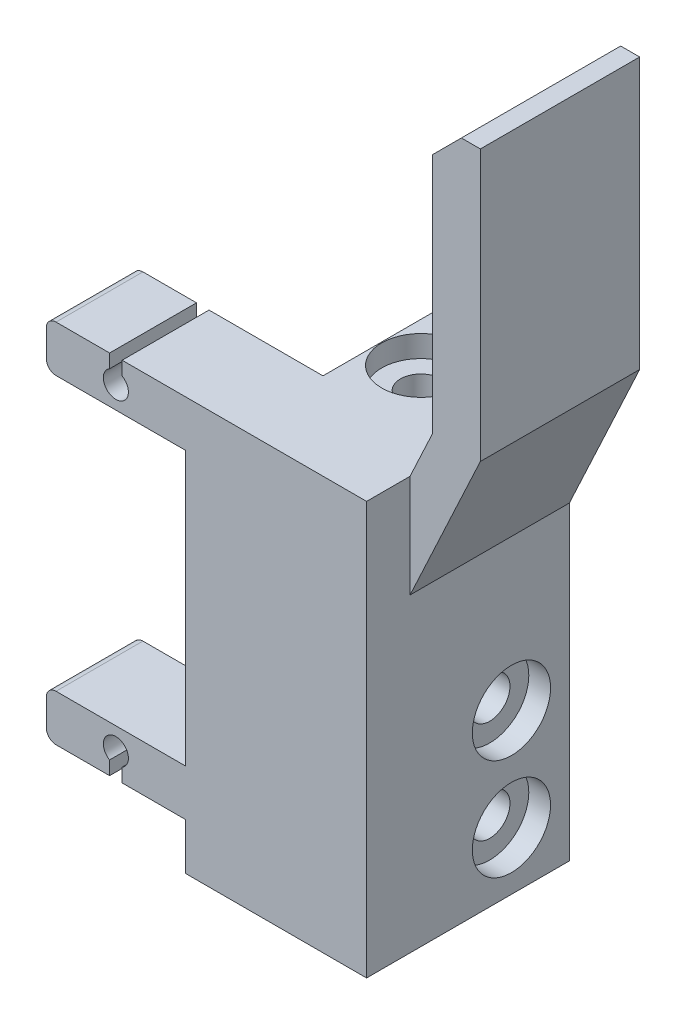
ISO-10303-21;
HEADER;
FILE_DESCRIPTION(('STEP AP214'),'2;1');
FILE_NAME('part.step','',(''),(''),'','','');
FILE_SCHEMA(('AUTOMOTIVE_DESIGN { 1 0 10303 214 1 1 1 1 }'));
ENDSEC;
DATA;
#1=APPLICATION_CONTEXT('core data for automotive mechanical design processes');
#2=APPLICATION_PROTOCOL_DEFINITION('international standard','automotive_design',2000,#1);
#3=PRODUCT_CONTEXT('',#1,'mechanical');
#4=PRODUCT('Part','Part','',(#3));
#5=PRODUCT_RELATED_PRODUCT_CATEGORY('part','',(#4));
#6=PRODUCT_DEFINITION_FORMATION('','',#4);
#7=PRODUCT_DEFINITION_CONTEXT('part definition',#1,'design');
#8=PRODUCT_DEFINITION('design','',#6,#7);
#9=PRODUCT_DEFINITION_SHAPE('','',#8);
#10=(LENGTH_UNIT() NAMED_UNIT(*) SI_UNIT(.MILLI.,.METRE.));
#11=(NAMED_UNIT(*) PLANE_ANGLE_UNIT() SI_UNIT($,.RADIAN.));
#12=(NAMED_UNIT(*) SI_UNIT($,.STERADIAN.) SOLID_ANGLE_UNIT());
#13=UNCERTAINTY_MEASURE_WITH_UNIT(LENGTH_MEASURE(1.E-05),#10,'distance_accuracy_value','');
#14=(GEOMETRIC_REPRESENTATION_CONTEXT(3) GLOBAL_UNCERTAINTY_ASSIGNED_CONTEXT((#13)) GLOBAL_UNIT_ASSIGNED_CONTEXT((#10,
#11,#12)) REPRESENTATION_CONTEXT('',''));
#15=CARTESIAN_POINT('',(0.,0.,0.));
#16=DIRECTION('',(0.,0.,1.));
#17=DIRECTION('',(1.,0.,0.));
#18=AXIS2_PLACEMENT_3D('',#15,#16,#17);
#19=CARTESIAN_POINT('',(-7.9450057,-15.875,-10.16));
#20=DIRECTION('',(1.,0.,0.));
#21=DIRECTION('',(0.,0.,-1.));
#22=AXIS2_PLACEMENT_3D('',#19,#20,#21);
#23=PLANE('',#22);
#24=CARTESIAN_POINT('',(-7.9450057,-10.795,-5.08));
#25=DIRECTION('',(-1.,0.,0.));
#26=DIRECTION('',(0.,0.,1.));
#27=AXIS2_PLACEMENT_3D('',#24,#25,#26);
#28=CIRCLE('',#27,3.42899999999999);
#29=CARTESIAN_POINT('',(-7.9450057,-10.795,-1.65100000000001));
#30=VERTEX_POINT('',#29);
#31=EDGE_CURVE('E520',#30,#30,#28,.T.);
#32=ORIENTED_EDGE('',*,*,#31,.F.);
#33=EDGE_LOOP('',(#32));
#34=FACE_BOUND('',#33,.T.);
#35=DIRECTION('',(0.,0.,1.));
#36=VECTOR('',#35,1.);
#37=CARTESIAN_POINT('',(-7.9450057,-15.875,-10.16));
#38=LINE('',#37,#36);
#39=CARTESIAN_POINT('',(-7.9450057,-15.875,-10.16));
#40=VERTEX_POINT('',#39);
#41=CARTESIAN_POINT('',(-7.9450057,-15.875,7.62));
#42=VERTEX_POINT('',#41);
#43=EDGE_CURVE('E332',#40,#42,#38,.T.);
#44=ORIENTED_EDGE('',*,*,#43,.T.);
#45=DIRECTION('',(0.,1.,0.));
#46=VECTOR('',#45,1.);
#47=CARTESIAN_POINT('',(-7.9450057,-15.875,7.62));
#48=LINE('',#47,#46);
#49=CARTESIAN_POINT('',(-7.9450057,-11.780012,7.62));
#50=VERTEX_POINT('',#49);
#51=EDGE_CURVE('E324',#42,#50,#48,.T.);
#52=ORIENTED_EDGE('',*,*,#51,.T.);
#53=DIRECTION('',(0.,0.,1.));
#54=VECTOR('',#53,1.);
#55=CARTESIAN_POINT('',(-7.9450057,-11.780012,-10.16));
#56=LINE('',#55,#54);
#57=CARTESIAN_POINT('',(-7.9450057,-11.780012,0.));
#58=VERTEX_POINT('',#57);
#59=EDGE_CURVE('E333',#58,#50,#56,.T.);
#60=ORIENTED_EDGE('',*,*,#59,.F.);
#61=DIRECTION('',(0.,1.,0.));
#62=VECTOR('',#61,1.);
#63=CARTESIAN_POINT('',(-7.9450057,3.175,0.));
#64=LINE('',#63,#62);
#65=CARTESIAN_POINT('',(-7.9450057,-7.716012,0.));
#66=VERTEX_POINT('',#65);
#67=EDGE_CURVE('E703',#58,#66,#64,.T.);
#68=ORIENTED_EDGE('',*,*,#67,.T.);
#69=DIRECTION('',(0.,0.,1.));
#70=VECTOR('',#69,1.);
#71=CARTESIAN_POINT('',(-7.9450057,-7.716012,-10.16));
#72=LINE('',#71,#70);
#73=CARTESIAN_POINT('',(-7.9450057,-7.716012,7.62));
#74=VERTEX_POINT('',#73);
#75=EDGE_CURVE('E691',#66,#74,#72,.T.);
#76=ORIENTED_EDGE('',*,*,#75,.T.);
#77=DIRECTION('',(0.,1.,0.));
#78=VECTOR('',#77,1.);
#79=CARTESIAN_POINT('',(-7.9450057,-7.716012,7.62));
#80=LINE('',#79,#78);
#81=CARTESIAN_POINT('',(-7.9450057,16.256,7.62));
#82=VERTEX_POINT('',#81);
#83=EDGE_CURVE('E687',#74,#82,#80,.T.);
#84=ORIENTED_EDGE('',*,*,#83,.T.);
#85=DIRECTION('',(0.,0.,1.));
#86=VECTOR('',#85,1.);
#87=CARTESIAN_POINT('',(-7.9450057,16.256,-10.16));
#88=LINE('',#87,#86);
#89=CARTESIAN_POINT('',(-7.9450057,16.256,0.));
#90=VERTEX_POINT('',#89);
#91=EDGE_CURVE('E315',#90,#82,#88,.T.);
#92=ORIENTED_EDGE('',*,*,#91,.F.);
#93=DIRECTION('',(0.,1.,0.));
#94=VECTOR('',#93,1.);
#95=CARTESIAN_POINT('',(-7.9450057,-15.875,0.));
#96=LINE('',#95,#94);
#97=CARTESIAN_POINT('',(-7.9450057,3.175,0.));
#98=VERTEX_POINT('',#97);
#99=EDGE_CURVE('E494',#98,#90,#96,.T.);
#100=ORIENTED_EDGE('',*,*,#99,.F.);
#101=DIRECTION('',(0.,0.,1.));
#102=VECTOR('',#101,1.);
#103=CARTESIAN_POINT('',(-7.9450057,3.175,-10.16));
#104=LINE('',#103,#102);
#105=CARTESIAN_POINT('',(-7.9450057,3.175,-10.16));
#106=VERTEX_POINT('',#105);
#107=EDGE_CURVE('E737',#106,#98,#104,.T.);
#108=ORIENTED_EDGE('',*,*,#107,.F.);
#109=DIRECTION('',(0.,1.,0.));
#110=VECTOR('',#109,1.);
#111=CARTESIAN_POINT('',(-7.9450057,3.175,-10.16));
#112=LINE('',#111,#110);
#113=EDGE_CURVE('E756',#40,#106,#112,.T.);
#114=ORIENTED_EDGE('',*,*,#113,.F.);
#115=EDGE_LOOP('',(#44,#52,#60,#68,#76,#84,#92,#100,#108,#114));
#116=FACE_BOUND('',#115,.T.);
#117=CARTESIAN_POINT('',(-7.9450057,-1.905,-5.08));
#118=DIRECTION('',(-1.,0.,0.));
#119=DIRECTION('',(0.,0.,1.));
#120=AXIS2_PLACEMENT_3D('',#117,#118,#119);
#121=CIRCLE('',#120,3.42899999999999);
#122=CARTESIAN_POINT('',(-7.9450057,-1.905,-1.65100000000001));
#123=VERTEX_POINT('',#122);
#124=EDGE_CURVE('E843',#123,#123,#121,.T.);
#125=ORIENTED_EDGE('',*,*,#124,.F.);
#126=EDGE_LOOP('',(#125));
#127=FACE_BOUND('',#126,.T.);
#128=ADVANCED_FACE('F47',(#34,#116,#127),#23,.F.);
#129=CARTESIAN_POINT('',(-20.1370057,-15.875,0.));
#130=DIRECTION('',(0.,0.,1.));
#131=DIRECTION('',(1.,0.,0.));
#132=AXIS2_PLACEMENT_3D('',#129,#130,#131);
#133=PLANE('',#132);
#134=DIRECTION('',(-1.,0.,0.));
#135=VECTOR('',#134,1.);
#136=CARTESIAN_POINT('',(-20.1370057,-11.780012,0.));
#137=LINE('',#136,#135);
#138=CARTESIAN_POINT('',(-14.5910046,-11.780012,0.));
#139=VERTEX_POINT('',#138);
#140=CARTESIAN_POINT('',(-19.2869947,-11.780012,0.));
#141=VERTEX_POINT('',#140);
#142=EDGE_CURVE('E476',#139,#141,#137,.T.);
#143=ORIENTED_EDGE('',*,*,#142,.T.);
#144=CARTESIAN_POINT('',(-19.2869947,-10.930001,0.));
#145=DIRECTION('',(0.,0.,1.));
#146=DIRECTION('',(1.,0.,0.));
#147=AXIS2_PLACEMENT_3D('',#144,#145,#146);
#148=CIRCLE('',#147,0.850011);
#149=CARTESIAN_POINT('',(-20.1370057,-10.930001,0.));
#150=VERTEX_POINT('',#149);
#151=EDGE_CURVE('E56',#141,#150,#148,.F.);
#152=ORIENTED_EDGE('',*,*,#151,.T.);
#153=DIRECTION('',(0.,1.,0.));
#154=VECTOR('',#153,1.);
#155=CARTESIAN_POINT('',(-20.1370057,-15.875,0.));
#156=LINE('',#155,#154);
#157=CARTESIAN_POINT('',(-20.1370057,-8.566023,0.));
#158=VERTEX_POINT('',#157);
#159=EDGE_CURVE('E383',#150,#158,#156,.T.);
#160=ORIENTED_EDGE('',*,*,#159,.T.);
#161=CARTESIAN_POINT('',(-19.2869947,-8.566023,0.));
#162=DIRECTION('',(0.,0.,1.));
#163=DIRECTION('',(1.,0.,0.));
#164=AXIS2_PLACEMENT_3D('',#161,#162,#163);
#165=CIRCLE('',#164,0.850011);
#166=CARTESIAN_POINT('',(-19.2869947,-7.716012,0.));
#167=VERTEX_POINT('',#166);
#168=EDGE_CURVE('E63',#158,#167,#165,.F.);
#169=ORIENTED_EDGE('',*,*,#168,.T.);
#170=DIRECTION('',(1.,0.,0.));
#171=VECTOR('',#170,1.);
#172=CARTESIAN_POINT('',(-20.1370057,-7.716012,0.));
#173=LINE('',#172,#171);
#174=EDGE_CURVE('E491',#167,#66,#173,.T.);
#175=ORIENTED_EDGE('',*,*,#174,.T.);
#176=ORIENTED_EDGE('',*,*,#67,.F.);
#177=CARTESIAN_POINT('',(-13.4910068,-11.780012,0.));
#178=VERTEX_POINT('',#177);
#179=EDGE_CURVE('E480',#58,#178,#137,.T.);
#180=ORIENTED_EDGE('',*,*,#179,.T.);
#181=DIRECTION('',(0.,1.,0.));
#182=VECTOR('',#181,1.);
#183=CARTESIAN_POINT('',(-13.4910068,-15.875,0.));
#184=LINE('',#183,#182);
#185=CARTESIAN_POINT('',(-13.4910068,-10.582629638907,0.));
#186=VERTEX_POINT('',#185);
#187=EDGE_CURVE('E303',#178,#186,#184,.T.);
#188=ORIENTED_EDGE('',*,*,#187,.T.);
#189=CARTESIAN_POINT('',(-14.0410057,-9.6300036,0.));
#190=DIRECTION('',(0.,0.,1.));
#191=DIRECTION('',(1.,0.,0.));
#192=AXIS2_PLACEMENT_3D('',#189,#190,#191);
#193=CIRCLE('',#192,1.09999780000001);
#194=CARTESIAN_POINT('',(-14.5910046,-10.582629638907,0.));
#195=VERTEX_POINT('',#194);
#196=EDGE_CURVE('E292',#186,#195,#193,.T.);
#197=ORIENTED_EDGE('',*,*,#196,.T.);
#198=DIRECTION('',(0.,-1.,0.));
#199=VECTOR('',#198,1.);
#200=CARTESIAN_POINT('',(-14.5910046,-15.875,0.));
#201=LINE('',#200,#199);
#202=EDGE_CURVE('E301',#195,#139,#201,.T.);
#203=ORIENTED_EDGE('',*,*,#202,.T.);
#204=EDGE_LOOP('',(#143,#152,#160,#169,#175,#176,#180,#188,#197,#203));
#205=FACE_BOUND('',#204,.T.);
#206=ADVANCED_FACE('F579',(#205),#133,.F.);
#207=CARTESIAN_POINT('',(-20.1370057,17.106011,0.));
#208=VERTEX_POINT('',#207);
#209=CARTESIAN_POINT('',(-20.1370057,19.469989,0.));
#210=VERTEX_POINT('',#209);
#211=EDGE_CURVE('E367',#208,#210,#156,.T.);
#212=ORIENTED_EDGE('',*,*,#211,.T.);
#213=CARTESIAN_POINT('',(-19.2869947,19.469989,0.));
#214=DIRECTION('',(0.,0.,1.));
#215=DIRECTION('',(1.,0.,0.));
#216=AXIS2_PLACEMENT_3D('',#213,#214,#215);
#217=CIRCLE('',#216,0.850011);
#218=CARTESIAN_POINT('',(-19.2869947,20.32,0.));
#219=VERTEX_POINT('',#218);
#220=EDGE_CURVE('E545',#210,#219,#217,.F.);
#221=ORIENTED_EDGE('',*,*,#220,.T.);
#222=DIRECTION('',(1.,0.,0.));
#223=VECTOR('',#222,1.);
#224=CARTESIAN_POINT('',(-20.1370057,20.32,0.));
#225=LINE('',#224,#223);
#226=CARTESIAN_POINT('',(-14.5910046,20.32,0.));
#227=VERTEX_POINT('',#226);
#228=EDGE_CURVE('E369',#219,#227,#225,.T.);
#229=ORIENTED_EDGE('',*,*,#228,.T.);
#230=DIRECTION('',(0.,-1.,0.));
#231=VECTOR('',#230,1.);
#232=CARTESIAN_POINT('',(-14.5910046,-15.875,0.));
#233=LINE('',#232,#231);
#234=CARTESIAN_POINT('',(-14.5910046,19.122617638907,0.));
#235=VERTEX_POINT('',#234);
#236=EDGE_CURVE('E501',#227,#235,#233,.T.);
#237=ORIENTED_EDGE('',*,*,#236,.T.);
#238=CARTESIAN_POINT('',(-14.0410057,18.1699916,0.));
#239=DIRECTION('',(0.,0.,-1.));
#240=DIRECTION('',(-1.,0.,0.));
#241=AXIS2_PLACEMENT_3D('',#238,#239,#240);
#242=CIRCLE('',#241,1.09999780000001);
#243=CARTESIAN_POINT('',(-13.4910068,19.122617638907,0.));
#244=VERTEX_POINT('',#243);
#245=EDGE_CURVE('E660',#244,#235,#242,.T.);
#246=ORIENTED_EDGE('',*,*,#245,.F.);
#247=DIRECTION('',(0.,1.,0.));
#248=VECTOR('',#247,1.);
#249=CARTESIAN_POINT('',(-13.4910068,-15.875,0.));
#250=LINE('',#249,#248);
#251=CARTESIAN_POINT('',(-13.4910068,20.32,0.));
#252=VERTEX_POINT('',#251);
#253=EDGE_CURVE('E505',#244,#252,#250,.T.);
#254=ORIENTED_EDGE('',*,*,#253,.T.);
#255=CARTESIAN_POINT('',(-3.5000057,20.32,0.));
#256=VERTEX_POINT('',#255);
#257=EDGE_CURVE('E358',#252,#256,#225,.T.);
#258=ORIENTED_EDGE('',*,*,#257,.T.);
#259=DIRECTION('',(0.,1.,0.));
#260=VECTOR('',#259,1.);
#261=CARTESIAN_POINT('',(-3.5000057,-15.875,0.));
#262=LINE('',#261,#260);
#263=CARTESIAN_POINT('',(-3.5000057,15.875,0.));
#264=VERTEX_POINT('',#263);
#265=EDGE_CURVE('E379',#264,#256,#262,.T.);
#266=ORIENTED_EDGE('',*,*,#265,.F.);
#267=DIRECTION('',(1.,0.,0.));
#268=VECTOR('',#267,1.);
#269=CARTESIAN_POINT('',(-3.5000057,15.875,0.));
#270=LINE('',#269,#268);
#271=CARTESIAN_POINT('',(3.50000569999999,15.875,0.));
#272=VERTEX_POINT('',#271);
#273=EDGE_CURVE('E339',#264,#272,#270,.T.);
#274=ORIENTED_EDGE('',*,*,#273,.T.);
#275=DIRECTION('',(0.,-1.,0.));
#276=VECTOR('',#275,1.);
#277=CARTESIAN_POINT('',(3.50000569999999,15.875,0.));
#278=LINE('',#277,#276);
#279=CARTESIAN_POINT('',(3.5000057,-15.875,0.));
#280=VERTEX_POINT('',#279);
#281=EDGE_CURVE('E343',#272,#280,#278,.T.);
#282=ORIENTED_EDGE('',*,*,#281,.T.);
#283=DIRECTION('',(1.,0.,0.));
#284=VECTOR('',#283,1.);
#285=CARTESIAN_POINT('',(-20.1370057,-15.875,0.));
#286=LINE('',#285,#284);
#287=CARTESIAN_POINT('',(-3.5000057,-15.875,0.));
#288=VERTEX_POINT('',#287);
#289=EDGE_CURVE('E364',#288,#280,#286,.T.);
#290=ORIENTED_EDGE('',*,*,#289,.F.);
#291=DIRECTION('',(0.,-1.,0.));
#292=VECTOR('',#291,1.);
#293=CARTESIAN_POINT('',(-3.5000057,-15.875,0.));
#294=LINE('',#293,#292);
#295=CARTESIAN_POINT('',(-3.5000057,3.175,0.));
#296=VERTEX_POINT('',#295);
#297=EDGE_CURVE('E752',#296,#288,#294,.T.);
#298=ORIENTED_EDGE('',*,*,#297,.F.);
#299=DIRECTION('',(1.,0.,0.));
#300=VECTOR('',#299,1.);
#301=CARTESIAN_POINT('',(-3.5000057,3.175,0.));
#302=LINE('',#301,#300);
#303=EDGE_CURVE('E757',#98,#296,#302,.T.);
#304=ORIENTED_EDGE('',*,*,#303,.F.);
#305=ORIENTED_EDGE('',*,*,#99,.T.);
#306=DIRECTION('',(-1.,0.,0.));
#307=VECTOR('',#306,1.);
#308=CARTESIAN_POINT('',(-20.1370057,16.256,0.));
#309=LINE('',#308,#307);
#310=CARTESIAN_POINT('',(-19.2869947,16.256,0.));
#311=VERTEX_POINT('',#310);
#312=EDGE_CURVE('E497',#90,#311,#309,.T.);
#313=ORIENTED_EDGE('',*,*,#312,.T.);
#314=CARTESIAN_POINT('',(-19.2869947,17.106011,0.));
#315=DIRECTION('',(0.,0.,1.));
#316=DIRECTION('',(1.,0.,0.));
#317=AXIS2_PLACEMENT_3D('',#314,#315,#316);
#318=CIRCLE('',#317,0.850011);
#319=EDGE_CURVE('E542',#311,#208,#318,.F.);
#320=ORIENTED_EDGE('',*,*,#319,.T.);
#321=EDGE_LOOP('',(#212,#221,#229,#237,#246,#254,#258,#266,#274,#282,#290,#298,#304,#305,#313,#320));
#322=FACE_BOUND('',#321,.T.);
#323=ADVANCED_FACE('F657',(#322),#133,.F.);
#324=CARTESIAN_POINT('',(-20.1370057,20.32,7.62));
#325=DIRECTION('',(0.,1.,0.));
#326=DIRECTION('',(0.,0.,1.));
#327=AXIS2_PLACEMENT_3D('',#324,#325,#326);
#328=PLANE('',#327);
#329=CARTESIAN_POINT('',(0.,20.32,-5.08));
#330=DIRECTION('',(0.,1.,0.));
#331=DIRECTION('',(0.,0.,1.));
#332=AXIS2_PLACEMENT_3D('',#329,#330,#331);
#333=CIRCLE('',#332,3.42899999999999);
#334=CARTESIAN_POINT('',(0.,20.32,-1.65100000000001));
#335=VERTEX_POINT('',#334);
#336=EDGE_CURVE('E817',#335,#335,#333,.T.);
#337=ORIENTED_EDGE('',*,*,#336,.F.);
#338=EDGE_LOOP('',(#337));
#339=FACE_BOUND('',#338,.T.);
#340=DIRECTION('',(0.,0.,-1.));
#341=VECTOR('',#340,1.);
#342=CARTESIAN_POINT('',(7.9450057,20.32,7.62));
#343=LINE('',#342,#341);
#344=CARTESIAN_POINT('',(7.9450057,20.32,7.62));
#345=VERTEX_POINT('',#344);
#346=CARTESIAN_POINT('',(7.9450057,20.32,3.81));
#347=VERTEX_POINT('',#346);
#348=EDGE_CURVE('E461',#345,#347,#343,.T.);
#349=ORIENTED_EDGE('',*,*,#348,.T.);
#350=DIRECTION('',(0.,0.,-1.));
#351=VECTOR('',#350,1.);
#352=CARTESIAN_POINT('',(7.9450057,20.32,-10.16));
#353=LINE('',#352,#351);
#354=CARTESIAN_POINT('',(7.9450057,20.32,-10.16));
#355=VERTEX_POINT('',#354);
#356=EDGE_CURVE('E509',#347,#355,#353,.T.);
#357=ORIENTED_EDGE('',*,*,#356,.T.);
#358=DIRECTION('',(1.,0.,0.));
#359=VECTOR('',#358,1.);
#360=CARTESIAN_POINT('',(-20.1370057,20.32,-10.16));
#361=LINE('',#360,#359);
#362=CARTESIAN_POINT('',(-3.5000057,20.32,-10.16));
#363=VERTEX_POINT('',#362);
#364=EDGE_CURVE('E432',#363,#355,#361,.T.);
#365=ORIENTED_EDGE('',*,*,#364,.F.);
#366=DIRECTION('',(0.,0.,-1.));
#367=VECTOR('',#366,1.);
#368=CARTESIAN_POINT('',(-3.5000057,20.32,0.));
#369=LINE('',#368,#367);
#370=EDGE_CURVE('E368',#256,#363,#369,.T.);
#371=ORIENTED_EDGE('',*,*,#370,.F.);
#372=ORIENTED_EDGE('',*,*,#257,.F.);
#373=DIRECTION('',(0.,0.,1.));
#374=VECTOR('',#373,1.);
#375=CARTESIAN_POINT('',(-13.4910068,20.32,-10.16));
#376=LINE('',#375,#374);
#377=CARTESIAN_POINT('',(-13.4910068,20.32,7.62));
#378=VERTEX_POINT('',#377);
#379=EDGE_CURVE('E603',#252,#378,#376,.T.);
#380=ORIENTED_EDGE('',*,*,#379,.T.);
#381=DIRECTION('',(1.,0.,0.));
#382=VECTOR('',#381,1.);
#383=CARTESIAN_POINT('',(-20.1370057,20.32,7.62));
#384=LINE('',#383,#382);
#385=EDGE_CURVE('E448',#378,#345,#384,.T.);
#386=ORIENTED_EDGE('',*,*,#385,.T.);
#387=EDGE_LOOP('',(#349,#357,#365,#371,#372,#380,#386));
#388=FACE_BOUND('',#387,.T.);
#389=ADVANCED_FACE('F600',(#339,#388),#328,.T.);
#390=CARTESIAN_POINT('',(-20.1370057,-15.875,7.62));
#391=DIRECTION('',(-1.,0.,0.));
#392=DIRECTION('',(0.,0.,1.));
#393=AXIS2_PLACEMENT_3D('',#390,#391,#392);
#394=PLANE('',#393);
#395=DIRECTION('',(0.,1.,0.));
#396=VECTOR('',#395,1.);
#397=CARTESIAN_POINT('',(-20.1370057,-15.875,7.62));
#398=LINE('',#397,#396);
#399=CARTESIAN_POINT('',(-20.1370057,17.106011,7.62));
#400=VERTEX_POINT('',#399);
#401=CARTESIAN_POINT('',(-20.1370057,19.469989,7.62));
#402=VERTEX_POINT('',#401);
#403=EDGE_CURVE('E449',#400,#402,#398,.T.);
#404=ORIENTED_EDGE('',*,*,#403,.T.);
#405=DIRECTION('',(0.,0.,-1.));
#406=VECTOR('',#405,1.);
#407=CARTESIAN_POINT('',(-20.1370057,19.469989,7.62));
#408=LINE('',#407,#406);
#409=EDGE_CURVE('E538',#402,#210,#408,.T.);
#410=ORIENTED_EDGE('',*,*,#409,.T.);
#411=ORIENTED_EDGE('',*,*,#211,.F.);
#412=DIRECTION('',(0.,0.,1.));
#413=VECTOR('',#412,1.);
#414=CARTESIAN_POINT('',(-20.1370057,17.106011,7.62));
#415=LINE('',#414,#413);
#416=EDGE_CURVE('E534',#208,#400,#415,.T.);
#417=ORIENTED_EDGE('',*,*,#416,.T.);
#418=EDGE_LOOP('',(#404,#410,#411,#417));
#419=FACE_BOUND('',#418,.T.);
#420=ADVANCED_FACE('F717',(#419),#394,.T.);
#421=CARTESIAN_POINT('',(-7.9450057,-11.780012,-10.16));
#422=DIRECTION('',(0.,1.,0.));
#423=DIRECTION('',(-1.,0.,0.));
#424=AXIS2_PLACEMENT_3D('',#421,#422,#423);
#425=PLANE('',#424);
#426=DIRECTION('',(-1.,0.,0.));
#427=VECTOR('',#426,1.);
#428=CARTESIAN_POINT('',(-7.9450057,-11.780012,7.62));
#429=LINE('',#428,#427);
#430=CARTESIAN_POINT('',(-14.5910046,-11.780012,7.62));
#431=VERTEX_POINT('',#430);
#432=CARTESIAN_POINT('',(-19.2869947,-11.780012,7.62));
#433=VERTEX_POINT('',#432);
#434=EDGE_CURVE('E308',#431,#433,#429,.T.);
#435=ORIENTED_EDGE('',*,*,#434,.T.);
#436=DIRECTION('',(0.,0.,1.));
#437=VECTOR('',#436,1.);
#438=CARTESIAN_POINT('',(-19.2869947,-11.780012,0.));
#439=LINE('',#438,#437);
#440=EDGE_CURVE('E71',#433,#141,#439,.F.);
#441=ORIENTED_EDGE('',*,*,#440,.T.);
#442=ORIENTED_EDGE('',*,*,#142,.F.);
#443=DIRECTION('',(0.,0.,1.));
#444=VECTOR('',#443,1.);
#445=CARTESIAN_POINT('',(-14.5910046,-11.780012,-10.16));
#446=LINE('',#445,#444);
#447=EDGE_CURVE('E488',#139,#431,#446,.T.);
#448=ORIENTED_EDGE('',*,*,#447,.T.);
#449=EDGE_LOOP('',(#435,#441,#442,#448));
#450=FACE_BOUND('',#449,.T.);
#451=ADVANCED_FACE('F587',(#450),#425,.F.);
#452=ORIENTED_EDGE('',*,*,#159,.F.);
#453=DIRECTION('',(0.,0.,1.));
#454=VECTOR('',#453,1.);
#455=CARTESIAN_POINT('',(-20.1370057,-10.930001,7.62));
#456=LINE('',#455,#454);
#457=CARTESIAN_POINT('',(-20.1370057,-10.930001,7.62));
#458=VERTEX_POINT('',#457);
#459=EDGE_CURVE('E569',#150,#458,#456,.T.);
#460=ORIENTED_EDGE('',*,*,#459,.T.);
#461=CARTESIAN_POINT('',(-20.1370057,-8.566023,7.62));
#462=VERTEX_POINT('',#461);
#463=EDGE_CURVE('E444',#458,#462,#398,.T.);
#464=ORIENTED_EDGE('',*,*,#463,.T.);
#465=DIRECTION('',(0.,0.,1.));
#466=VECTOR('',#465,1.);
#467=CARTESIAN_POINT('',(-20.1370057,-8.566023,0.));
#468=LINE('',#467,#466);
#469=EDGE_CURVE('E566',#462,#158,#468,.F.);
#470=ORIENTED_EDGE('',*,*,#469,.T.);
#471=EDGE_LOOP('',(#452,#460,#464,#470));
#472=FACE_BOUND('',#471,.T.);
#473=ADVANCED_FACE('F583',(#472),#394,.T.);
#474=CARTESIAN_POINT('',(7.9450057,-15.875,7.62));
#475=DIRECTION('',(0.,-1.,0.));
#476=DIRECTION('',(0.,0.,-1.));
#477=AXIS2_PLACEMENT_3D('',#474,#475,#476);
#478=PLANE('',#477);
#479=ORIENTED_EDGE('',*,*,#43,.F.);
#480=DIRECTION('',(-1.,0.,0.));
#481=VECTOR('',#480,1.);
#482=CARTESIAN_POINT('',(-7.9450057,-15.875,-10.16));
#483=LINE('',#482,#481);
#484=CARTESIAN_POINT('',(-3.5000057,-15.875,-10.16));
#485=VERTEX_POINT('',#484);
#486=EDGE_CURVE('E751',#485,#40,#483,.T.);
#487=ORIENTED_EDGE('',*,*,#486,.F.);
#488=DIRECTION('',(0.,0.,1.));
#489=VECTOR('',#488,1.);
#490=CARTESIAN_POINT('',(-3.5000057,-15.875,-10.16));
#491=LINE('',#490,#489);
#492=EDGE_CURVE('E747',#485,#288,#491,.T.);
#493=ORIENTED_EDGE('',*,*,#492,.T.);
#494=ORIENTED_EDGE('',*,*,#289,.T.);
#495=DIRECTION('',(0.,0.,-1.));
#496=VECTOR('',#495,1.);
#497=CARTESIAN_POINT('',(3.5000057,-15.875,0.));
#498=LINE('',#497,#496);
#499=CARTESIAN_POINT('',(3.5000057,-15.875,-10.16));
#500=VERTEX_POINT('',#499);
#501=EDGE_CURVE('E354',#280,#500,#498,.T.);
#502=ORIENTED_EDGE('',*,*,#501,.T.);
#503=DIRECTION('',(-1.,0.,0.));
#504=VECTOR('',#503,1.);
#505=CARTESIAN_POINT('',(7.9450057,-15.875,-10.16));
#506=LINE('',#505,#504);
#507=CARTESIAN_POINT('',(7.9450057,-15.875,-10.16));
#508=VERTEX_POINT('',#507);
#509=EDGE_CURVE('E468',#508,#500,#506,.T.);
#510=ORIENTED_EDGE('',*,*,#509,.F.);
#511=DIRECTION('',(0.,0.,-1.));
#512=VECTOR('',#511,1.);
#513=CARTESIAN_POINT('',(7.9450057,-15.875,7.62));
#514=LINE('',#513,#512);
#515=CARTESIAN_POINT('',(7.9450057,-15.875,7.62));
#516=VERTEX_POINT('',#515);
#517=EDGE_CURVE('E472',#516,#508,#514,.T.);
#518=ORIENTED_EDGE('',*,*,#517,.F.);
#519=DIRECTION('',(-1.,0.,0.));
#520=VECTOR('',#519,1.);
#521=CARTESIAN_POINT('',(7.9450057,-15.875,7.62));
#522=LINE('',#521,#520);
#523=EDGE_CURVE('E457',#516,#42,#522,.T.);
#524=ORIENTED_EDGE('',*,*,#523,.T.);
#525=EDGE_LOOP('',(#479,#487,#493,#494,#502,#510,#518,#524));
#526=FACE_BOUND('',#525,.T.);
#527=ADVANCED_FACE('F613',(#526),#478,.T.);
#528=CARTESIAN_POINT('',(7.9450057,20.32,7.62));
#529=DIRECTION('',(1.,0.,0.));
#530=DIRECTION('',(0.,0.,-1.));
#531=AXIS2_PLACEMENT_3D('',#528,#529,#530);
#532=PLANE('',#531);
#533=CARTESIAN_POINT('',(7.9450057,-1.905,-5.08));
#534=DIRECTION('',(1.,0.,0.));
#535=DIRECTION('',(0.,0.,-1.));
#536=AXIS2_PLACEMENT_3D('',#533,#534,#535);
#537=CIRCLE('',#536,3.42899999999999);
#538=CARTESIAN_POINT('',(7.9450057,-1.905,-8.509));
#539=VERTEX_POINT('',#538);
#540=EDGE_CURVE('E514',#539,#539,#537,.T.);
#541=ORIENTED_EDGE('',*,*,#540,.F.);
#542=EDGE_LOOP('',(#541));
#543=FACE_BOUND('',#542,.T.);
#544=CARTESIAN_POINT('',(7.9450057,-10.795,-5.08));
#545=DIRECTION('',(1.,0.,0.));
#546=DIRECTION('',(0.,0.,-1.));
#547=AXIS2_PLACEMENT_3D('',#544,#545,#546);
#548=CIRCLE('',#547,3.42899999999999);
#549=CARTESIAN_POINT('',(7.9450057,-10.795,-8.509));
#550=VERTEX_POINT('',#549);
#551=EDGE_CURVE('E791',#550,#550,#548,.T.);
#552=ORIENTED_EDGE('',*,*,#551,.F.);
#553=EDGE_LOOP('',(#552));
#554=FACE_BOUND('',#553,.T.);
#555=DIRECTION('',(0.,0.,-1.));
#556=VECTOR('',#555,1.);
#557=CARTESIAN_POINT('',(7.9450057,11.304771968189,3.81));
#558=LINE('',#557,#556);
#559=CARTESIAN_POINT('',(7.9450057,11.304771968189,3.81));
#560=VERTEX_POINT('',#559);
#561=CARTESIAN_POINT('',(7.9450057,11.304771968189,-10.16));
#562=VERTEX_POINT('',#561);
#563=EDGE_CURVE('E433',#560,#562,#558,.T.);
#564=ORIENTED_EDGE('',*,*,#563,.F.);
#565=DIRECTION('',(0.,1.,0.));
#566=VECTOR('',#565,1.);
#567=CARTESIAN_POINT('',(7.9450057,11.304771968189,3.81));
#568=LINE('',#567,#566);
#569=EDGE_CURVE('E403',#560,#347,#568,.T.);
#570=ORIENTED_EDGE('',*,*,#569,.T.);
#571=ORIENTED_EDGE('',*,*,#348,.F.);
#572=DIRECTION('',(0.,-1.,0.));
#573=VECTOR('',#572,1.);
#574=CARTESIAN_POINT('',(7.9450057,20.32,7.62));
#575=LINE('',#574,#573);
#576=EDGE_CURVE('E453',#345,#516,#575,.T.);
#577=ORIENTED_EDGE('',*,*,#576,.T.);
#578=ORIENTED_EDGE('',*,*,#517,.T.);
#579=DIRECTION('',(0.,-1.,0.));
#580=VECTOR('',#579,1.);
#581=CARTESIAN_POINT('',(7.9450057,20.32,-10.16));
#582=LINE('',#581,#580);
#583=EDGE_CURVE('E465',#562,#508,#582,.T.);
#584=ORIENTED_EDGE('',*,*,#583,.F.);
#585=EDGE_LOOP('',(#564,#570,#571,#577,#578,#584));
#586=FACE_BOUND('',#585,.T.);
#587=ADVANCED_FACE('F608',(#543,#554,#586),#532,.T.);
#588=ORIENTED_EDGE('',*,*,#228,.F.);
#589=DIRECTION('',(0.,0.,-1.));
#590=VECTOR('',#589,1.);
#591=CARTESIAN_POINT('',(-19.2869947,20.32,7.62));
#592=LINE('',#591,#590);
#593=CARTESIAN_POINT('',(-19.2869947,20.32,7.62));
#594=VERTEX_POINT('',#593);
#595=EDGE_CURVE('E548',#219,#594,#592,.F.);
#596=ORIENTED_EDGE('',*,*,#595,.T.);
#597=CARTESIAN_POINT('',(-14.5910046,20.32,7.62));
#598=VERTEX_POINT('',#597);
#599=EDGE_CURVE('E450',#594,#598,#384,.T.);
#600=ORIENTED_EDGE('',*,*,#599,.T.);
#601=DIRECTION('',(0.,0.,1.));
#602=VECTOR('',#601,1.);
#603=CARTESIAN_POINT('',(-14.5910046,20.32,-10.16));
#604=LINE('',#603,#602);
#605=EDGE_CURVE('E681',#227,#598,#604,.T.);
#606=ORIENTED_EDGE('',*,*,#605,.F.);
#607=EDGE_LOOP('',(#588,#596,#600,#606));
#608=FACE_BOUND('',#607,.T.);
#609=ADVANCED_FACE('F727',(#608),#328,.T.);
#610=CARTESIAN_POINT('',(0.,0.,7.62));
#611=DIRECTION('',(0.,0.,-1.));
#612=DIRECTION('',(-1.,0.,0.));
#613=AXIS2_PLACEMENT_3D('',#610,#611,#612);
#614=PLANE('',#613);
#615=ORIENTED_EDGE('',*,*,#599,.F.);
#616=CARTESIAN_POINT('',(-19.2869947,19.469989,7.62));
#617=DIRECTION('',(0.,0.,-1.));
#618=DIRECTION('',(-1.,0.,0.));
#619=AXIS2_PLACEMENT_3D('',#616,#617,#618);
#620=CIRCLE('',#619,0.850011);
#621=EDGE_CURVE('E560',#594,#402,#620,.F.);
#622=ORIENTED_EDGE('',*,*,#621,.T.);
#623=ORIENTED_EDGE('',*,*,#403,.F.);
#624=CARTESIAN_POINT('',(-19.2869947,17.106011,7.62));
#625=DIRECTION('',(0.,0.,-1.));
#626=DIRECTION('',(-1.,0.,0.));
#627=AXIS2_PLACEMENT_3D('',#624,#625,#626);
#628=CIRCLE('',#627,0.850011);
#629=CARTESIAN_POINT('',(-19.2869947,16.256,7.62));
#630=VERTEX_POINT('',#629);
#631=EDGE_CURVE('E557',#400,#630,#628,.F.);
#632=ORIENTED_EDGE('',*,*,#631,.T.);
#633=DIRECTION('',(-1.,0.,0.));
#634=VECTOR('',#633,1.);
#635=CARTESIAN_POINT('',(-7.9450057,16.256,7.62));
#636=LINE('',#635,#634);
#637=EDGE_CURVE('E667',#82,#630,#636,.T.);
#638=ORIENTED_EDGE('',*,*,#637,.F.);
#639=ORIENTED_EDGE('',*,*,#83,.F.);
#640=DIRECTION('',(1.,0.,0.));
#641=VECTOR('',#640,1.);
#642=CARTESIAN_POINT('',(-20.1370057,-7.716012,7.62));
#643=LINE('',#642,#641);
#644=CARTESIAN_POINT('',(-19.2869947,-7.716012,7.62));
#645=VERTEX_POINT('',#644);
#646=EDGE_CURVE('E672',#645,#74,#643,.T.);
#647=ORIENTED_EDGE('',*,*,#646,.F.);
#648=CARTESIAN_POINT('',(-19.2869947,-8.566023,7.62));
#649=DIRECTION('',(0.,0.,-1.));
#650=DIRECTION('',(-1.,0.,0.));
#651=AXIS2_PLACEMENT_3D('',#648,#649,#650);
#652=CIRCLE('',#651,0.850011);
#653=EDGE_CURVE('E551',#645,#462,#652,.F.);
#654=ORIENTED_EDGE('',*,*,#653,.T.);
#655=ORIENTED_EDGE('',*,*,#463,.F.);
#656=CARTESIAN_POINT('',(-19.2869947,-10.930001,7.62));
#657=DIRECTION('',(0.,0.,-1.));
#658=DIRECTION('',(-1.,0.,0.));
#659=AXIS2_PLACEMENT_3D('',#656,#657,#658);
#660=CIRCLE('',#659,0.850011);
#661=EDGE_CURVE('E554',#458,#433,#660,.F.);
#662=ORIENTED_EDGE('',*,*,#661,.T.);
#663=ORIENTED_EDGE('',*,*,#434,.F.);
#664=DIRECTION('',(0.,-1.,0.));
#665=VECTOR('',#664,1.);
#666=CARTESIAN_POINT('',(-14.5910046,-10.582629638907,7.62));
#667=LINE('',#666,#665);
#668=CARTESIAN_POINT('',(-14.5910046,-10.582629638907,7.62));
#669=VERTEX_POINT('',#668);
#670=EDGE_CURVE('E298',#669,#431,#667,.T.);
#671=ORIENTED_EDGE('',*,*,#670,.F.);
#672=CARTESIAN_POINT('',(-14.0410057,-9.6300036,7.62));
#673=DIRECTION('',(0.,0.,1.));
#674=DIRECTION('',(1.,0.,0.));
#675=AXIS2_PLACEMENT_3D('',#672,#673,#674);
#676=CIRCLE('',#675,1.09999780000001);
#677=CARTESIAN_POINT('',(-13.4910068,-10.582629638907,7.62));
#678=VERTEX_POINT('',#677);
#679=EDGE_CURVE('E280',#678,#669,#676,.T.);
#680=ORIENTED_EDGE('',*,*,#679,.F.);
#681=DIRECTION('',(0.,1.,0.));
#682=VECTOR('',#681,1.);
#683=CARTESIAN_POINT('',(-13.4910068,-11.780012,7.62));
#684=LINE('',#683,#682);
#685=CARTESIAN_POINT('',(-13.4910068,-11.780012,7.62));
#686=VERTEX_POINT('',#685);
#687=EDGE_CURVE('E310',#686,#678,#684,.T.);
#688=ORIENTED_EDGE('',*,*,#687,.F.);
#689=EDGE_CURVE('E328',#50,#686,#429,.T.);
#690=ORIENTED_EDGE('',*,*,#689,.F.);
#691=ORIENTED_EDGE('',*,*,#51,.F.);
#692=ORIENTED_EDGE('',*,*,#523,.F.);
#693=ORIENTED_EDGE('',*,*,#576,.F.);
#694=ORIENTED_EDGE('',*,*,#385,.F.);
#695=DIRECTION('',(0.,1.,0.));
#696=VECTOR('',#695,1.);
#697=CARTESIAN_POINT('',(-13.4910068,19.122617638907,7.62));
#698=LINE('',#697,#696);
#699=CARTESIAN_POINT('',(-13.4910068,19.122617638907,7.62));
#700=VERTEX_POINT('',#699);
#701=EDGE_CURVE('E665',#700,#378,#698,.T.);
#702=ORIENTED_EDGE('',*,*,#701,.F.);
#703=CARTESIAN_POINT('',(-14.0410057,18.1699916,7.62));
#704=DIRECTION('',(0.,0.,-1.));
#705=DIRECTION('',(-1.,0.,0.));
#706=AXIS2_PLACEMENT_3D('',#703,#704,#705);
#707=CIRCLE('',#706,1.09999780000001);
#708=CARTESIAN_POINT('',(-14.5910046,19.122617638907,7.62));
#709=VERTEX_POINT('',#708);
#710=EDGE_CURVE('E735',#700,#709,#707,.T.);
#711=ORIENTED_EDGE('',*,*,#710,.T.);
#712=DIRECTION('',(0.,-1.,0.));
#713=VECTOR('',#712,1.);
#714=CARTESIAN_POINT('',(-14.5910046,20.32,7.62));
#715=LINE('',#714,#713);
#716=EDGE_CURVE('E733',#598,#709,#715,.T.);
#717=ORIENTED_EDGE('',*,*,#716,.F.);
#718=EDGE_LOOP('',(#615,#622,#623,#632,#638,#639,#647,#654,#655,#662,#663,#671,#680,#688,#690,
#691,#692,#693,#694,#702,#711,#717));
#719=FACE_BOUND('',#718,.T.);
#720=ADVANCED_FACE('F307',(#719),#614,.F.);
#721=CARTESIAN_POINT('',(0.,0.,-10.16));
#722=DIRECTION('',(0.,0.,-1.));
#723=DIRECTION('',(-1.,0.,0.));
#724=AXIS2_PLACEMENT_3D('',#721,#722,#723);
#725=PLANE('',#724);
#726=DIRECTION('',(0.,-1.,0.));
#727=VECTOR('',#726,1.);
#728=CARTESIAN_POINT('',(3.50000569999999,15.875,-10.16));
#729=LINE('',#728,#727);
#730=CARTESIAN_POINT('',(3.50000569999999,15.875,-10.16));
#731=VERTEX_POINT('',#730);
#732=EDGE_CURVE('E344',#731,#500,#729,.T.);
#733=ORIENTED_EDGE('',*,*,#732,.F.);
#734=DIRECTION('',(1.,0.,0.));
#735=VECTOR('',#734,1.);
#736=CARTESIAN_POINT('',(-3.5000057,15.875,-10.16));
#737=LINE('',#736,#735);
#738=CARTESIAN_POINT('',(-3.5000057,15.875,-10.16));
#739=VERTEX_POINT('',#738);
#740=EDGE_CURVE('E336',#739,#731,#737,.T.);
#741=ORIENTED_EDGE('',*,*,#740,.F.);
#742=DIRECTION('',(0.,1.,0.));
#743=VECTOR('',#742,1.);
#744=CARTESIAN_POINT('',(-3.5000057,-15.875,-10.16));
#745=LINE('',#744,#743);
#746=EDGE_CURVE('E375',#739,#363,#745,.T.);
#747=ORIENTED_EDGE('',*,*,#746,.T.);
#748=ORIENTED_EDGE('',*,*,#364,.T.);
#749=DIRECTION('',(-0.422618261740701,-0.906307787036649,0.));
#750=VECTOR('',#749,1.);
#751=CARTESIAN_POINT('',(7.9450057,20.32,-10.16));
#752=LINE('',#751,#750);
#753=CARTESIAN_POINT('',(9.906,24.5253658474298,-10.16));
#754=VERTEX_POINT('',#753);
#755=EDGE_CURVE('E528',#355,#754,#752,.F.);
#756=ORIENTED_EDGE('',*,*,#755,.T.);
#757=DIRECTION('',(0.,1.,0.));
#758=VECTOR('',#757,1.);
#759=CARTESIAN_POINT('',(9.906,20.32,-10.16));
#760=LINE('',#759,#758);
#761=CARTESIAN_POINT('',(9.906,45.72,-10.16));
#762=VERTEX_POINT('',#761);
#763=EDGE_CURVE('E391',#754,#762,#760,.T.);
#764=ORIENTED_EDGE('',*,*,#763,.T.);
#765=DIRECTION('',(0.707106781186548,0.707106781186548,0.));
#766=VECTOR('',#765,1.);
#767=CARTESIAN_POINT('',(9.906,45.72,-10.16));
#768=LINE('',#767,#766);
#769=CARTESIAN_POINT('',(12.446,48.26,-10.16));
#770=VERTEX_POINT('',#769);
#771=EDGE_CURVE('E378',#762,#770,#768,.T.);
#772=ORIENTED_EDGE('',*,*,#771,.T.);
#773=DIRECTION('',(1.,0.,0.));
#774=VECTOR('',#773,1.);
#775=CARTESIAN_POINT('',(12.446,48.26,-10.16));
#776=LINE('',#775,#774);
#777=CARTESIAN_POINT('',(14.1098698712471,48.26,-10.16));
#778=VERTEX_POINT('',#777);
#779=EDGE_CURVE('E414',#770,#778,#776,.T.);
#780=ORIENTED_EDGE('',*,*,#779,.T.);
#781=DIRECTION('',(0.,-1.,0.));
#782=VECTOR('',#781,1.);
#783=CARTESIAN_POINT('',(14.1098698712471,48.26,-10.16));
#784=LINE('',#783,#782);
#785=CARTESIAN_POINT('',(14.1098698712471,24.5253658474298,-10.16));
#786=VERTEX_POINT('',#785);
#787=EDGE_CURVE('E418',#778,#786,#784,.T.);
#788=ORIENTED_EDGE('',*,*,#787,.T.);
#789=DIRECTION('',(-0.4226182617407,-0.90630778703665,0.));
#790=VECTOR('',#789,1.);
#791=CARTESIAN_POINT('',(14.1098698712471,24.5253658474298,-10.16));
#792=LINE('',#791,#790);
#793=EDGE_CURVE('E422',#786,#562,#792,.T.);
#794=ORIENTED_EDGE('',*,*,#793,.T.);
#795=ORIENTED_EDGE('',*,*,#583,.T.);
#796=ORIENTED_EDGE('',*,*,#509,.T.);
#797=EDGE_LOOP('',(#733,#741,#747,#748,#756,#764,#772,#780,#788,#794,#795,#796));
#798=FACE_BOUND('',#797,.T.);
#799=ADVANCED_FACE('F620',(#798),#725,.T.);
#800=CARTESIAN_POINT('',(9.906,45.72,3.81));
#801=DIRECTION('',(-0.707106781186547,0.707106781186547,0.));
#802=DIRECTION('',(-0.707106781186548,-0.707106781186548,0.));
#803=AXIS2_PLACEMENT_3D('',#800,#801,#802);
#804=PLANE('',#803);
#805=ORIENTED_EDGE('',*,*,#771,.F.);
#806=DIRECTION('',(0.,0.,-1.));
#807=VECTOR('',#806,1.);
#808=CARTESIAN_POINT('',(9.906,45.72,3.81));
#809=LINE('',#808,#807);
#810=CARTESIAN_POINT('',(9.906,45.72,3.81));
#811=VERTEX_POINT('',#810);
#812=EDGE_CURVE('E428',#811,#762,#809,.T.);
#813=ORIENTED_EDGE('',*,*,#812,.F.);
#814=DIRECTION('',(0.707106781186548,0.707106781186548,0.));
#815=VECTOR('',#814,1.);
#816=CARTESIAN_POINT('',(9.906,45.72,3.81));
#817=LINE('',#816,#815);
#818=CARTESIAN_POINT('',(12.446,48.26,3.81));
#819=VERTEX_POINT('',#818);
#820=EDGE_CURVE('E386',#811,#819,#817,.T.);
#821=ORIENTED_EDGE('',*,*,#820,.T.);
#822=DIRECTION('',(0.,0.,-1.));
#823=VECTOR('',#822,1.);
#824=CARTESIAN_POINT('',(12.446,48.26,3.81));
#825=LINE('',#824,#823);
#826=EDGE_CURVE('E410',#819,#770,#825,.T.);
#827=ORIENTED_EDGE('',*,*,#826,.T.);
#828=EDGE_LOOP('',(#805,#813,#821,#827));
#829=FACE_BOUND('',#828,.T.);
#830=ADVANCED_FACE('F640',(#829),#804,.T.);
#831=CARTESIAN_POINT('',(9.906,20.32,3.81));
#832=DIRECTION('',(-1.,0.,0.));
#833=DIRECTION('',(0.,0.,1.));
#834=AXIS2_PLACEMENT_3D('',#831,#832,#833);
#835=PLANE('',#834);
#836=ORIENTED_EDGE('',*,*,#763,.F.);
#837=DIRECTION('',(0.,0.,1.));
#838=VECTOR('',#837,1.);
#839=CARTESIAN_POINT('',(9.906,24.5253658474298,3.81));
#840=LINE('',#839,#838);
#841=CARTESIAN_POINT('',(9.906,24.5253658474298,3.81));
#842=VERTEX_POINT('',#841);
#843=EDGE_CURVE('E525',#754,#842,#840,.T.);
#844=ORIENTED_EDGE('',*,*,#843,.T.);
#845=DIRECTION('',(0.,1.,0.));
#846=VECTOR('',#845,1.);
#847=CARTESIAN_POINT('',(9.906,20.32,3.81));
#848=LINE('',#847,#846);
#849=EDGE_CURVE('E407',#842,#811,#848,.T.);
#850=ORIENTED_EDGE('',*,*,#849,.T.);
#851=ORIENTED_EDGE('',*,*,#812,.T.);
#852=EDGE_LOOP('',(#836,#844,#850,#851));
#853=FACE_BOUND('',#852,.T.);
#854=ADVANCED_FACE('F643',(#853),#835,.T.);
#855=CARTESIAN_POINT('',(14.1098698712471,24.5253658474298,3.81));
#856=DIRECTION('',(0.90630778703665,-0.4226182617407,0.));
#857=DIRECTION('',(0.4226182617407,0.90630778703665,0.));
#858=AXIS2_PLACEMENT_3D('',#855,#856,#857);
#859=PLANE('',#858);
#860=ORIENTED_EDGE('',*,*,#793,.F.);
#861=DIRECTION('',(0.,0.,-1.));
#862=VECTOR('',#861,1.);
#863=CARTESIAN_POINT('',(14.1098698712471,24.5253658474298,3.81));
#864=LINE('',#863,#862);
#865=CARTESIAN_POINT('',(14.1098698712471,24.5253658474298,3.81));
#866=VERTEX_POINT('',#865);
#867=EDGE_CURVE('E436',#866,#786,#864,.T.);
#868=ORIENTED_EDGE('',*,*,#867,.F.);
#869=DIRECTION('',(-0.4226182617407,-0.90630778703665,0.));
#870=VECTOR('',#869,1.);
#871=CARTESIAN_POINT('',(14.1098698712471,24.5253658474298,3.81));
#872=LINE('',#871,#870);
#873=EDGE_CURVE('E399',#866,#560,#872,.T.);
#874=ORIENTED_EDGE('',*,*,#873,.T.);
#875=ORIENTED_EDGE('',*,*,#563,.T.);
#876=EDGE_LOOP('',(#860,#868,#874,#875));
#877=FACE_BOUND('',#876,.T.);
#878=ADVANCED_FACE('F624',(#877),#859,.T.);
#879=CARTESIAN_POINT('',(14.1098698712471,48.26,3.81));
#880=DIRECTION('',(1.,0.,0.));
#881=DIRECTION('',(0.,0.,-1.));
#882=AXIS2_PLACEMENT_3D('',#879,#880,#881);
#883=PLANE('',#882);
#884=ORIENTED_EDGE('',*,*,#787,.F.);
#885=DIRECTION('',(0.,0.,-1.));
#886=VECTOR('',#885,1.);
#887=CARTESIAN_POINT('',(14.1098698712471,48.26,3.81));
#888=LINE('',#887,#886);
#889=CARTESIAN_POINT('',(14.1098698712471,48.26,3.81));
#890=VERTEX_POINT('',#889);
#891=EDGE_CURVE('E439',#890,#778,#888,.T.);
#892=ORIENTED_EDGE('',*,*,#891,.F.);
#893=DIRECTION('',(0.,-1.,0.));
#894=VECTOR('',#893,1.);
#895=CARTESIAN_POINT('',(14.1098698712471,48.26,3.81));
#896=LINE('',#895,#894);
#897=EDGE_CURVE('E395',#890,#866,#896,.T.);
#898=ORIENTED_EDGE('',*,*,#897,.T.);
#899=ORIENTED_EDGE('',*,*,#867,.T.);
#900=EDGE_LOOP('',(#884,#892,#898,#899));
#901=FACE_BOUND('',#900,.T.);
#902=ADVANCED_FACE('F632',(#901),#883,.T.);
#903=CARTESIAN_POINT('',(12.446,48.26,3.81));
#904=DIRECTION('',(0.,1.,0.));
#905=DIRECTION('',(0.,0.,1.));
#906=AXIS2_PLACEMENT_3D('',#903,#904,#905);
#907=PLANE('',#906);
#908=ORIENTED_EDGE('',*,*,#779,.F.);
#909=ORIENTED_EDGE('',*,*,#826,.F.);
#910=DIRECTION('',(1.,0.,0.));
#911=VECTOR('',#910,1.);
#912=CARTESIAN_POINT('',(12.446,48.26,3.81));
#913=LINE('',#912,#911);
#914=EDGE_CURVE('E390',#819,#890,#913,.T.);
#915=ORIENTED_EDGE('',*,*,#914,.T.);
#916=ORIENTED_EDGE('',*,*,#891,.T.);
#917=EDGE_LOOP('',(#908,#909,#915,#916));
#918=FACE_BOUND('',#917,.T.);
#919=ADVANCED_FACE('F635',(#918),#907,.T.);
#920=CARTESIAN_POINT('',(0.,0.,3.81));
#921=DIRECTION('',(0.,0.,-1.));
#922=DIRECTION('',(-1.,0.,0.));
#923=AXIS2_PLACEMENT_3D('',#920,#921,#922);
#924=PLANE('',#923);
#925=ORIENTED_EDGE('',*,*,#820,.F.);
#926=ORIENTED_EDGE('',*,*,#849,.F.);
#927=DIRECTION('',(0.422618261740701,0.906307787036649,0.));
#928=VECTOR('',#927,1.);
#929=CARTESIAN_POINT('',(-1.25703308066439,0.586164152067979,3.81));
#930=LINE('',#929,#928);
#931=EDGE_CURVE('E531',#842,#347,#930,.F.);
#932=ORIENTED_EDGE('',*,*,#931,.T.);
#933=ORIENTED_EDGE('',*,*,#569,.F.);
#934=ORIENTED_EDGE('',*,*,#873,.F.);
#935=ORIENTED_EDGE('',*,*,#897,.F.);
#936=ORIENTED_EDGE('',*,*,#914,.F.);
#937=EDGE_LOOP('',(#925,#926,#932,#933,#934,#935,#936));
#938=FACE_BOUND('',#937,.T.);
#939=ADVANCED_FACE('F629',(#938),#924,.F.);
#940=CARTESIAN_POINT('',(-3.5000057,-15.875,0.));
#941=DIRECTION('',(1.,0.,0.));
#942=DIRECTION('',(0.,0.,-1.));
#943=AXIS2_PLACEMENT_3D('',#940,#941,#942);
#944=PLANE('',#943);
#945=ORIENTED_EDGE('',*,*,#746,.F.);
#946=DIRECTION('',(0.,0.,-1.));
#947=VECTOR('',#946,1.);
#948=CARTESIAN_POINT('',(-3.5000057,15.875,0.));
#949=LINE('',#948,#947);
#950=EDGE_CURVE('E348',#264,#739,#949,.T.);
#951=ORIENTED_EDGE('',*,*,#950,.F.);
#952=ORIENTED_EDGE('',*,*,#265,.T.);
#953=ORIENTED_EDGE('',*,*,#370,.T.);
#954=EDGE_LOOP('',(#945,#951,#952,#953));
#955=FACE_BOUND('',#954,.T.);
#956=ADVANCED_FACE('F654',(#955),#944,.F.);
#957=CARTESIAN_POINT('',(3.50000569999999,15.875,0.));
#958=DIRECTION('',(1.,0.,0.));
#959=DIRECTION('',(0.,1.,0.));
#960=AXIS2_PLACEMENT_3D('',#957,#958,#959);
#961=PLANE('',#960);
#962=CARTESIAN_POINT('',(3.50000569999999,-1.905,-5.08));
#963=DIRECTION('',(1.,0.,0.));
#964=DIRECTION('',(0.,1.,0.));
#965=AXIS2_PLACEMENT_3D('',#962,#963,#964);
#966=CIRCLE('',#965,1.77800000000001);
#967=CARTESIAN_POINT('',(3.50000569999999,-0.126999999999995,-5.08));
#968=VERTEX_POINT('',#967);
#969=EDGE_CURVE('E795',#968,#968,#966,.T.);
#970=ORIENTED_EDGE('',*,*,#969,.T.);
#971=EDGE_LOOP('',(#970));
#972=FACE_BOUND('',#971,.T.);
#973=CARTESIAN_POINT('',(3.5000057,-10.795,-5.08));
#974=DIRECTION('',(1.,0.,0.));
#975=DIRECTION('',(0.,1.,0.));
#976=AXIS2_PLACEMENT_3D('',#973,#974,#975);
#977=CIRCLE('',#976,1.77800000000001);
#978=CARTESIAN_POINT('',(3.50000569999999,-9.017,-5.08));
#979=VERTEX_POINT('',#978);
#980=EDGE_CURVE('E293',#979,#979,#977,.T.);
#981=ORIENTED_EDGE('',*,*,#980,.T.);
#982=EDGE_LOOP('',(#981));
#983=FACE_BOUND('',#982,.T.);
#984=ORIENTED_EDGE('',*,*,#732,.T.);
#985=ORIENTED_EDGE('',*,*,#501,.F.);
#986=ORIENTED_EDGE('',*,*,#281,.F.);
#987=DIRECTION('',(0.,0.,-1.));
#988=VECTOR('',#987,1.);
#989=CARTESIAN_POINT('',(3.50000569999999,15.875,0.));
#990=LINE('',#989,#988);
#991=EDGE_CURVE('E359',#272,#731,#990,.T.);
#992=ORIENTED_EDGE('',*,*,#991,.T.);
#993=EDGE_LOOP('',(#984,#985,#986,#992));
#994=FACE_BOUND('',#993,.T.);
#995=ADVANCED_FACE('F863',(#972,#983,#994),#961,.F.);
#996=CARTESIAN_POINT('',(-3.5000057,15.875,0.));
#997=DIRECTION('',(0.,1.,0.));
#998=DIRECTION('',(0.,0.,1.));
#999=AXIS2_PLACEMENT_3D('',#996,#997,#998);
#1000=PLANE('',#999);
#1001=CARTESIAN_POINT('',(0.,15.875,-5.08));
#1002=DIRECTION('',(0.,1.,0.));
#1003=DIRECTION('',(0.,0.,1.));
#1004=AXIS2_PLACEMENT_3D('',#1001,#1002,#1003);
#1005=CIRCLE('',#1004,1.77800000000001);
#1006=CARTESIAN_POINT('',(0.,15.875,-3.30199999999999));
#1007=VERTEX_POINT('',#1006);
#1008=EDGE_CURVE('E510',#1007,#1007,#1005,.T.);
#1009=ORIENTED_EDGE('',*,*,#1008,.T.);
#1010=EDGE_LOOP('',(#1009));
#1011=FACE_BOUND('',#1010,.T.);
#1012=ORIENTED_EDGE('',*,*,#740,.T.);
#1013=ORIENTED_EDGE('',*,*,#991,.F.);
#1014=ORIENTED_EDGE('',*,*,#273,.F.);
#1015=ORIENTED_EDGE('',*,*,#950,.T.);
#1016=EDGE_LOOP('',(#1012,#1013,#1014,#1015));
#1017=FACE_BOUND('',#1016,.T.);
#1018=ADVANCED_FACE('F866',(#1011,#1017),#1000,.F.);
#1019=ORIENTED_EDGE('',*,*,#689,.T.);
#1020=DIRECTION('',(0.,0.,-1.));
#1021=VECTOR('',#1020,1.);
#1022=CARTESIAN_POINT('',(-13.4910068,-11.780012,-10.16));
#1023=LINE('',#1022,#1021);
#1024=EDGE_CURVE('E484',#686,#178,#1023,.T.);
#1025=ORIENTED_EDGE('',*,*,#1024,.T.);
#1026=ORIENTED_EDGE('',*,*,#179,.F.);
#1027=ORIENTED_EDGE('',*,*,#59,.T.);
#1028=EDGE_LOOP('',(#1019,#1025,#1026,#1027));
#1029=FACE_BOUND('',#1028,.T.);
#1030=ADVANCED_FACE('F861',(#1029),#425,.F.);
#1031=CARTESIAN_POINT('',(-14.5910046,-10.582629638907,-10.16));
#1032=DIRECTION('',(-1.,0.,0.));
#1033=DIRECTION('',(0.,0.,1.));
#1034=AXIS2_PLACEMENT_3D('',#1031,#1032,#1033);
#1035=PLANE('',#1034);
#1036=DIRECTION('',(0.,0.,1.));
#1037=VECTOR('',#1036,1.);
#1038=CARTESIAN_POINT('',(-14.5910046,-10.582629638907,-10.16));
#1039=LINE('',#1038,#1037);
#1040=EDGE_CURVE('E283',#195,#669,#1039,.T.);
#1041=ORIENTED_EDGE('',*,*,#1040,.T.);
#1042=ORIENTED_EDGE('',*,*,#670,.T.);
#1043=ORIENTED_EDGE('',*,*,#447,.F.);
#1044=ORIENTED_EDGE('',*,*,#202,.F.);
#1045=EDGE_LOOP('',(#1041,#1042,#1043,#1044));
#1046=FACE_BOUND('',#1045,.T.);
#1047=ADVANCED_FACE('F297',(#1046),#1035,.F.);
#1048=CARTESIAN_POINT('',(-13.4910068,-11.780012,-10.16));
#1049=DIRECTION('',(1.,0.,0.));
#1050=DIRECTION('',(0.,0.,-1.));
#1051=AXIS2_PLACEMENT_3D('',#1048,#1049,#1050);
#1052=PLANE('',#1051);
#1053=ORIENTED_EDGE('',*,*,#1024,.F.);
#1054=ORIENTED_EDGE('',*,*,#687,.T.);
#1055=DIRECTION('',(0.,0.,1.));
#1056=VECTOR('',#1055,1.);
#1057=CARTESIAN_POINT('',(-13.4910068,-10.582629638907,-10.16));
#1058=LINE('',#1057,#1056);
#1059=EDGE_CURVE('E286',#186,#678,#1058,.T.);
#1060=ORIENTED_EDGE('',*,*,#1059,.F.);
#1061=ORIENTED_EDGE('',*,*,#187,.F.);
#1062=EDGE_LOOP('',(#1053,#1054,#1060,#1061));
#1063=FACE_BOUND('',#1062,.T.);
#1064=ADVANCED_FACE('F918',(#1063),#1052,.F.);
#1065=CARTESIAN_POINT('',(-7.9450057,16.256,-10.16));
#1066=DIRECTION('',(0.,1.,0.));
#1067=DIRECTION('',(0.,0.,1.));
#1068=AXIS2_PLACEMENT_3D('',#1065,#1066,#1067);
#1069=PLANE('',#1068);
#1070=ORIENTED_EDGE('',*,*,#637,.T.);
#1071=DIRECTION('',(0.,0.,1.));
#1072=VECTOR('',#1071,1.);
#1073=CARTESIAN_POINT('',(-19.2869947,16.256,0.));
#1074=LINE('',#1073,#1072);
#1075=EDGE_CURVE('E563',#630,#311,#1074,.F.);
#1076=ORIENTED_EDGE('',*,*,#1075,.T.);
#1077=ORIENTED_EDGE('',*,*,#312,.F.);
#1078=ORIENTED_EDGE('',*,*,#91,.T.);
#1079=EDGE_LOOP('',(#1070,#1076,#1077,#1078));
#1080=FACE_BOUND('',#1079,.T.);
#1081=ADVANCED_FACE('F709',(#1080),#1069,.F.);
#1082=CARTESIAN_POINT('',(-20.1370057,-7.716012,-10.16));
#1083=DIRECTION('',(0.,-1.,0.));
#1084=DIRECTION('',(1.,0.,0.));
#1085=AXIS2_PLACEMENT_3D('',#1082,#1083,#1084);
#1086=PLANE('',#1085);
#1087=ORIENTED_EDGE('',*,*,#174,.F.);
#1088=DIRECTION('',(0.,0.,1.));
#1089=VECTOR('',#1088,1.);
#1090=CARTESIAN_POINT('',(-19.2869947,-7.716012,7.62));
#1091=LINE('',#1090,#1089);
#1092=EDGE_CURVE('E11',#167,#645,#1091,.T.);
#1093=ORIENTED_EDGE('',*,*,#1092,.T.);
#1094=ORIENTED_EDGE('',*,*,#646,.T.);
#1095=ORIENTED_EDGE('',*,*,#75,.F.);
#1096=EDGE_LOOP('',(#1087,#1093,#1094,#1095));
#1097=FACE_BOUND('',#1096,.T.);
#1098=ADVANCED_FACE('F914',(#1097),#1086,.F.);
#1099=CARTESIAN_POINT('',(-13.4910068,19.122617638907,-10.16));
#1100=DIRECTION('',(1.,0.,0.));
#1101=DIRECTION('',(0.,0.,-1.));
#1102=AXIS2_PLACEMENT_3D('',#1099,#1100,#1101);
#1103=PLANE('',#1102);
#1104=DIRECTION('',(0.,0.,1.));
#1105=VECTOR('',#1104,1.);
#1106=CARTESIAN_POINT('',(-13.4910068,19.122617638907,-10.16));
#1107=LINE('',#1106,#1105);
#1108=EDGE_CURVE('E664',#244,#700,#1107,.T.);
#1109=ORIENTED_EDGE('',*,*,#1108,.T.);
#1110=ORIENTED_EDGE('',*,*,#701,.T.);
#1111=ORIENTED_EDGE('',*,*,#379,.F.);
#1112=ORIENTED_EDGE('',*,*,#253,.F.);
#1113=EDGE_LOOP('',(#1109,#1110,#1111,#1112));
#1114=FACE_BOUND('',#1113,.T.);
#1115=ADVANCED_FACE('F663',(#1114),#1103,.F.);
#1116=CARTESIAN_POINT('',(-14.5910046,20.32,-10.16));
#1117=DIRECTION('',(-1.,0.,0.));
#1118=DIRECTION('',(0.,0.,1.));
#1119=AXIS2_PLACEMENT_3D('',#1116,#1117,#1118);
#1120=PLANE('',#1119);
#1121=ORIENTED_EDGE('',*,*,#605,.T.);
#1122=ORIENTED_EDGE('',*,*,#716,.T.);
#1123=DIRECTION('',(0.,0.,1.));
#1124=VECTOR('',#1123,1.);
#1125=CARTESIAN_POINT('',(-14.5910046,19.122617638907,-10.16));
#1126=LINE('',#1125,#1124);
#1127=EDGE_CURVE('E674',#235,#709,#1126,.T.);
#1128=ORIENTED_EDGE('',*,*,#1127,.F.);
#1129=ORIENTED_EDGE('',*,*,#236,.F.);
#1130=EDGE_LOOP('',(#1121,#1122,#1128,#1129));
#1131=FACE_BOUND('',#1130,.T.);
#1132=ADVANCED_FACE('F731',(#1131),#1120,.F.);
#1133=CARTESIAN_POINT('',(-3.5000057,3.175,-10.16));
#1134=DIRECTION('',(0.,-1.,0.));
#1135=DIRECTION('',(0.,0.,-1.));
#1136=AXIS2_PLACEMENT_3D('',#1133,#1134,#1135);
#1137=PLANE('',#1136);
#1138=ORIENTED_EDGE('',*,*,#303,.T.);
#1139=DIRECTION('',(0.,0.,1.));
#1140=VECTOR('',#1139,1.);
#1141=CARTESIAN_POINT('',(-3.5000057,3.175,-10.16));
#1142=LINE('',#1141,#1140);
#1143=CARTESIAN_POINT('',(-3.5000057,3.175,-10.16));
#1144=VERTEX_POINT('',#1143);
#1145=EDGE_CURVE('E741',#1144,#296,#1142,.T.);
#1146=ORIENTED_EDGE('',*,*,#1145,.F.);
#1147=DIRECTION('',(1.,0.,0.));
#1148=VECTOR('',#1147,1.);
#1149=CARTESIAN_POINT('',(-3.5000057,3.175,-10.16));
#1150=LINE('',#1149,#1148);
#1151=EDGE_CURVE('E768',#106,#1144,#1150,.T.);
#1152=ORIENTED_EDGE('',*,*,#1151,.F.);
#1153=ORIENTED_EDGE('',*,*,#107,.T.);
#1154=EDGE_LOOP('',(#1138,#1146,#1152,#1153));
#1155=FACE_BOUND('',#1154,.T.);
#1156=ADVANCED_FACE('F932',(#1155),#1137,.F.);
#1157=CARTESIAN_POINT('',(-3.5000057,-15.875,-10.16));
#1158=DIRECTION('',(-1.,0.,0.));
#1159=DIRECTION('',(0.,0.,1.));
#1160=AXIS2_PLACEMENT_3D('',#1157,#1158,#1159);
#1161=PLANE('',#1160);
#1162=CARTESIAN_POINT('',(-3.5000057,-1.905,-5.08));
#1163=DIRECTION('',(-1.,0.,0.));
#1164=DIRECTION('',(0.,0.,1.));
#1165=AXIS2_PLACEMENT_3D('',#1162,#1163,#1164);
#1166=CIRCLE('',#1165,1.77800000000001);
#1167=CARTESIAN_POINT('',(-3.5000057,-1.905,-3.30199999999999));
#1168=VERTEX_POINT('',#1167);
#1169=EDGE_CURVE('E516',#1168,#1168,#1166,.T.);
#1170=ORIENTED_EDGE('',*,*,#1169,.T.);
#1171=EDGE_LOOP('',(#1170));
#1172=FACE_BOUND('',#1171,.T.);
#1173=CARTESIAN_POINT('',(-3.5000057,-10.795,-5.08));
#1174=DIRECTION('',(-1.,0.,0.));
#1175=DIRECTION('',(0.,0.,1.));
#1176=AXIS2_PLACEMENT_3D('',#1173,#1174,#1175);
#1177=CIRCLE('',#1176,1.77800000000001);
#1178=CARTESIAN_POINT('',(-3.5000057,-10.795,-3.30199999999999));
#1179=VERTEX_POINT('',#1178);
#1180=EDGE_CURVE('E821',#1179,#1179,#1177,.T.);
#1181=ORIENTED_EDGE('',*,*,#1180,.T.);
#1182=EDGE_LOOP('',(#1181));
#1183=FACE_BOUND('',#1182,.T.);
#1184=ORIENTED_EDGE('',*,*,#297,.T.);
#1185=ORIENTED_EDGE('',*,*,#492,.F.);
#1186=DIRECTION('',(0.,-1.,0.));
#1187=VECTOR('',#1186,1.);
#1188=CARTESIAN_POINT('',(-3.5000057,-15.875,-10.16));
#1189=LINE('',#1188,#1187);
#1190=EDGE_CURVE('E765',#1144,#485,#1189,.T.);
#1191=ORIENTED_EDGE('',*,*,#1190,.F.);
#1192=ORIENTED_EDGE('',*,*,#1145,.T.);
#1193=EDGE_LOOP('',(#1184,#1185,#1191,#1192));
#1194=FACE_BOUND('',#1193,.T.);
#1195=ADVANCED_FACE('F937',(#1172,#1183,#1194),#1161,.F.);
#1196=CARTESIAN_POINT('',(0.,0.,-10.16));
#1197=DIRECTION('',(0.,0.,1.));
#1198=DIRECTION('',(1.,0.,0.));
#1199=AXIS2_PLACEMENT_3D('',#1196,#1197,#1198);
#1200=PLANE('',#1199);
#1201=ORIENTED_EDGE('',*,*,#113,.T.);
#1202=ORIENTED_EDGE('',*,*,#1151,.T.);
#1203=ORIENTED_EDGE('',*,*,#1190,.T.);
#1204=ORIENTED_EDGE('',*,*,#486,.T.);
#1205=EDGE_LOOP('',(#1201,#1202,#1203,#1204));
#1206=FACE_BOUND('',#1205,.T.);
#1207=ADVANCED_FACE('F940',(#1206),#1200,.F.);
#1208=CARTESIAN_POINT('',(-14.0410057,18.1699916,7.62));
#1209=DIRECTION('',(0.,0.,-1.));
#1210=DIRECTION('',(-1.,0.,0.));
#1211=AXIS2_PLACEMENT_3D('',#1208,#1209,#1210);
#1212=CYLINDRICAL_SURFACE('',#1211,1.09999780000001);
#1213=ORIENTED_EDGE('',*,*,#245,.T.);
#1214=ORIENTED_EDGE('',*,*,#1127,.T.);
#1215=ORIENTED_EDGE('',*,*,#710,.F.);
#1216=ORIENTED_EDGE('',*,*,#1108,.F.);
#1217=EDGE_LOOP('',(#1213,#1214,#1215,#1216));
#1218=FACE_BOUND('',#1217,.T.);
#1219=ADVANCED_FACE('F944',(#1218),#1212,.F.);
#1220=CARTESIAN_POINT('',(-14.0410057,-9.6300036,0.));
#1221=DIRECTION('',(0.,0.,1.));
#1222=DIRECTION('',(1.,0.,0.));
#1223=AXIS2_PLACEMENT_3D('',#1220,#1221,#1222);
#1224=CYLINDRICAL_SURFACE('',#1223,1.09999780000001);
#1225=ORIENTED_EDGE('',*,*,#196,.F.);
#1226=ORIENTED_EDGE('',*,*,#1059,.T.);
#1227=ORIENTED_EDGE('',*,*,#679,.T.);
#1228=ORIENTED_EDGE('',*,*,#1040,.F.);
#1229=EDGE_LOOP('',(#1225,#1226,#1227,#1228));
#1230=FACE_BOUND('',#1229,.T.);
#1231=ADVANCED_FACE('F282',(#1230),#1224,.F.);
#1232=CARTESIAN_POINT('',(7.9450057,-10.795,-5.08));
#1233=DIRECTION('',(1.,0.,0.));
#1234=DIRECTION('',(0.,0.,-1.));
#1235=AXIS2_PLACEMENT_3D('',#1232,#1233,#1234);
#1236=CYLINDRICAL_SURFACE('',#1235,1.77800000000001);
#1237=ORIENTED_EDGE('',*,*,#980,.F.);
#1238=EDGE_LOOP('',(#1237));
#1239=FACE_BOUND('',#1238,.T.);
#1240=CARTESIAN_POINT('',(6.0400057,-10.795,-5.08));
#1241=DIRECTION('',(1.,0.,0.));
#1242=DIRECTION('',(0.,0.,-1.));
#1243=AXIS2_PLACEMENT_3D('',#1240,#1241,#1242);
#1244=CIRCLE('',#1243,1.77800000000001);
#1245=CARTESIAN_POINT('',(6.0400057,-10.795,-6.85800000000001));
#1246=VERTEX_POINT('',#1245);
#1247=EDGE_CURVE('E783',#1246,#1246,#1244,.T.);
#1248=ORIENTED_EDGE('',*,*,#1247,.T.);
#1249=EDGE_LOOP('',(#1248));
#1250=FACE_BOUND('',#1249,.T.);
#1251=ADVANCED_FACE('F950',(#1239,#1250),#1236,.F.);
#1252=CARTESIAN_POINT('',(6.0400057,-9.01699999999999,-5.08));
#1253=DIRECTION('',(-1.,0.,0.));
#1254=DIRECTION('',(0.,0.,1.));
#1255=AXIS2_PLACEMENT_3D('',#1252,#1253,#1254);
#1256=PLANE('',#1255);
#1257=ORIENTED_EDGE('',*,*,#1247,.F.);
#1258=EDGE_LOOP('',(#1257));
#1259=FACE_BOUND('',#1258,.T.);
#1260=CARTESIAN_POINT('',(6.0400057,-10.795,-5.08));
#1261=DIRECTION('',(1.,0.,0.));
#1262=DIRECTION('',(0.,0.,-1.));
#1263=AXIS2_PLACEMENT_3D('',#1260,#1261,#1262);
#1264=CIRCLE('',#1263,3.42899999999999);
#1265=CARTESIAN_POINT('',(6.0400057,-10.795,-8.509));
#1266=VERTEX_POINT('',#1265);
#1267=EDGE_CURVE('E787',#1266,#1266,#1264,.T.);
#1268=ORIENTED_EDGE('',*,*,#1267,.T.);
#1269=EDGE_LOOP('',(#1268));
#1270=FACE_BOUND('',#1269,.T.);
#1271=ADVANCED_FACE('F953',(#1259,#1270),#1256,.F.);
#1272=CARTESIAN_POINT('',(7.9450057,-10.795,-5.08));
#1273=DIRECTION('',(1.,0.,0.));
#1274=DIRECTION('',(0.,0.,-1.));
#1275=AXIS2_PLACEMENT_3D('',#1272,#1273,#1274);
#1276=CYLINDRICAL_SURFACE('',#1275,3.42899999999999);
#1277=ORIENTED_EDGE('',*,*,#1267,.F.);
#1278=EDGE_LOOP('',(#1277));
#1279=FACE_BOUND('',#1278,.T.);
#1280=ORIENTED_EDGE('',*,*,#551,.T.);
#1281=EDGE_LOOP('',(#1280));
#1282=FACE_BOUND('',#1281,.T.);
#1283=ADVANCED_FACE('F957',(#1279,#1282),#1276,.F.);
#1284=CARTESIAN_POINT('',(7.9450057,-1.905,-5.08));
#1285=DIRECTION('',(1.,0.,0.));
#1286=DIRECTION('',(0.,0.,-1.));
#1287=AXIS2_PLACEMENT_3D('',#1284,#1285,#1286);
#1288=CYLINDRICAL_SURFACE('',#1287,1.77800000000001);
#1289=ORIENTED_EDGE('',*,*,#969,.F.);
#1290=EDGE_LOOP('',(#1289));
#1291=FACE_BOUND('',#1290,.T.);
#1292=CARTESIAN_POINT('',(6.0400057,-1.905,-5.08));
#1293=DIRECTION('',(1.,0.,0.));
#1294=DIRECTION('',(0.,0.,-1.));
#1295=AXIS2_PLACEMENT_3D('',#1292,#1293,#1294);
#1296=CIRCLE('',#1295,1.77800000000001);
#1297=CARTESIAN_POINT('',(6.0400057,-1.905,-6.85800000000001));
#1298=VERTEX_POINT('',#1297);
#1299=EDGE_CURVE('E799',#1298,#1298,#1296,.T.);
#1300=ORIENTED_EDGE('',*,*,#1299,.T.);
#1301=EDGE_LOOP('',(#1300));
#1302=FACE_BOUND('',#1301,.T.);
#1303=ADVANCED_FACE('F961',(#1291,#1302),#1288,.F.);
#1304=CARTESIAN_POINT('',(6.0400057,-0.126999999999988,-5.08));
#1305=DIRECTION('',(-1.,0.,0.));
#1306=DIRECTION('',(0.,0.,1.));
#1307=AXIS2_PLACEMENT_3D('',#1304,#1305,#1306);
#1308=PLANE('',#1307);
#1309=ORIENTED_EDGE('',*,*,#1299,.F.);
#1310=EDGE_LOOP('',(#1309));
#1311=FACE_BOUND('',#1310,.T.);
#1312=CARTESIAN_POINT('',(6.0400057,-1.905,-5.08));
#1313=DIRECTION('',(1.,0.,0.));
#1314=DIRECTION('',(0.,0.,-1.));
#1315=AXIS2_PLACEMENT_3D('',#1312,#1313,#1314);
#1316=CIRCLE('',#1315,3.42899999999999);
#1317=CARTESIAN_POINT('',(6.0400057,-1.905,-8.509));
#1318=VERTEX_POINT('',#1317);
#1319=EDGE_CURVE('E803',#1318,#1318,#1316,.T.);
#1320=ORIENTED_EDGE('',*,*,#1319,.T.);
#1321=EDGE_LOOP('',(#1320));
#1322=FACE_BOUND('',#1321,.T.);
#1323=ADVANCED_FACE('F965',(#1311,#1322),#1308,.F.);
#1324=CARTESIAN_POINT('',(7.9450057,-1.905,-5.08));
#1325=DIRECTION('',(1.,0.,0.));
#1326=DIRECTION('',(0.,0.,-1.));
#1327=AXIS2_PLACEMENT_3D('',#1324,#1325,#1326);
#1328=CYLINDRICAL_SURFACE('',#1327,3.42899999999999);
#1329=ORIENTED_EDGE('',*,*,#1319,.F.);
#1330=EDGE_LOOP('',(#1329));
#1331=FACE_BOUND('',#1330,.T.);
#1332=ORIENTED_EDGE('',*,*,#540,.T.);
#1333=EDGE_LOOP('',(#1332));
#1334=FACE_BOUND('',#1333,.T.);
#1335=ADVANCED_FACE('F969',(#1331,#1334),#1328,.F.);
#1336=CARTESIAN_POINT('',(0.,20.32,-5.08));
#1337=DIRECTION('',(0.,1.,0.));
#1338=DIRECTION('',(0.,0.,1.));
#1339=AXIS2_PLACEMENT_3D('',#1336,#1337,#1338);
#1340=CYLINDRICAL_SURFACE('',#1339,1.77800000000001);
#1341=CARTESIAN_POINT('',(0.,18.415,-5.08));
#1342=DIRECTION('',(0.,1.,0.));
#1343=DIRECTION('',(0.,0.,1.));
#1344=AXIS2_PLACEMENT_3D('',#1341,#1342,#1343);
#1345=CIRCLE('',#1344,1.77800000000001);
#1346=CARTESIAN_POINT('',(0.,18.415,-3.30199999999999));
#1347=VERTEX_POINT('',#1346);
#1348=EDGE_CURVE('E515',#1347,#1347,#1345,.T.);
#1349=ORIENTED_EDGE('',*,*,#1348,.T.);
#1350=EDGE_LOOP('',(#1349));
#1351=FACE_BOUND('',#1350,.T.);
#1352=ORIENTED_EDGE('',*,*,#1008,.F.);
#1353=EDGE_LOOP('',(#1352));
#1354=FACE_BOUND('',#1353,.T.);
#1355=ADVANCED_FACE('F973',(#1351,#1354),#1340,.F.);
#1356=CARTESIAN_POINT('',(1.77800000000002,18.415,-5.08));
#1357=DIRECTION('',(0.,-1.,0.));
#1358=DIRECTION('',(0.,0.,-1.));
#1359=AXIS2_PLACEMENT_3D('',#1356,#1357,#1358);
#1360=PLANE('',#1359);
#1361=ORIENTED_EDGE('',*,*,#1348,.F.);
#1362=EDGE_LOOP('',(#1361));
#1363=FACE_BOUND('',#1362,.T.);
#1364=CARTESIAN_POINT('',(0.,18.415,-5.08));
#1365=DIRECTION('',(0.,1.,0.));
#1366=DIRECTION('',(0.,0.,1.));
#1367=AXIS2_PLACEMENT_3D('',#1364,#1365,#1366);
#1368=CIRCLE('',#1367,3.42899999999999);
#1369=CARTESIAN_POINT('',(0.,18.415,-1.65100000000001));
#1370=VERTEX_POINT('',#1369);
#1371=EDGE_CURVE('E813',#1370,#1370,#1368,.T.);
#1372=ORIENTED_EDGE('',*,*,#1371,.T.);
#1373=EDGE_LOOP('',(#1372));
#1374=FACE_BOUND('',#1373,.T.);
#1375=ADVANCED_FACE('F977',(#1363,#1374),#1360,.F.);
#1376=CARTESIAN_POINT('',(0.,20.32,-5.08));
#1377=DIRECTION('',(0.,1.,0.));
#1378=DIRECTION('',(0.,0.,1.));
#1379=AXIS2_PLACEMENT_3D('',#1376,#1377,#1378);
#1380=CYLINDRICAL_SURFACE('',#1379,3.42899999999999);
#1381=ORIENTED_EDGE('',*,*,#1371,.F.);
#1382=EDGE_LOOP('',(#1381));
#1383=FACE_BOUND('',#1382,.T.);
#1384=ORIENTED_EDGE('',*,*,#336,.T.);
#1385=EDGE_LOOP('',(#1384));
#1386=FACE_BOUND('',#1385,.T.);
#1387=ADVANCED_FACE('F981',(#1383,#1386),#1380,.F.);
#1388=CARTESIAN_POINT('',(-7.9450057,-10.795,-5.08));
#1389=DIRECTION('',(-1.,0.,0.));
#1390=DIRECTION('',(0.,0.,1.));
#1391=AXIS2_PLACEMENT_3D('',#1388,#1389,#1390);
#1392=CYLINDRICAL_SURFACE('',#1391,1.77800000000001);
#1393=CARTESIAN_POINT('',(-6.0400057,-10.795,-5.08));
#1394=DIRECTION('',(-1.,0.,0.));
#1395=DIRECTION('',(0.,0.,1.));
#1396=AXIS2_PLACEMENT_3D('',#1393,#1394,#1395);
#1397=CIRCLE('',#1396,1.77800000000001);
#1398=CARTESIAN_POINT('',(-6.0400057,-10.795,-3.30199999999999));
#1399=VERTEX_POINT('',#1398);
#1400=EDGE_CURVE('E825',#1399,#1399,#1397,.T.);
#1401=ORIENTED_EDGE('',*,*,#1400,.T.);
#1402=EDGE_LOOP('',(#1401));
#1403=FACE_BOUND('',#1402,.T.);
#1404=ORIENTED_EDGE('',*,*,#1180,.F.);
#1405=EDGE_LOOP('',(#1404));
#1406=FACE_BOUND('',#1405,.T.);
#1407=ADVANCED_FACE('F984',(#1403,#1406),#1392,.F.);
#1408=CARTESIAN_POINT('',(-6.0400057,-9.01699999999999,-5.08));
#1409=DIRECTION('',(1.,0.,0.));
#1410=DIRECTION('',(0.,0.,-1.));
#1411=AXIS2_PLACEMENT_3D('',#1408,#1409,#1410);
#1412=PLANE('',#1411);
#1413=ORIENTED_EDGE('',*,*,#1400,.F.);
#1414=EDGE_LOOP('',(#1413));
#1415=FACE_BOUND('',#1414,.T.);
#1416=CARTESIAN_POINT('',(-6.0400057,-10.795,-5.08));
#1417=DIRECTION('',(-1.,0.,0.));
#1418=DIRECTION('',(0.,0.,1.));
#1419=AXIS2_PLACEMENT_3D('',#1416,#1417,#1418);
#1420=CIRCLE('',#1419,3.42899999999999);
#1421=CARTESIAN_POINT('',(-6.0400057,-10.795,-1.65100000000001));
#1422=VERTEX_POINT('',#1421);
#1423=EDGE_CURVE('E829',#1422,#1422,#1420,.T.);
#1424=ORIENTED_EDGE('',*,*,#1423,.T.);
#1425=EDGE_LOOP('',(#1424));
#1426=FACE_BOUND('',#1425,.T.);
#1427=ADVANCED_FACE('F988',(#1415,#1426),#1412,.F.);
#1428=CARTESIAN_POINT('',(-7.9450057,-10.795,-5.08));
#1429=DIRECTION('',(-1.,0.,0.));
#1430=DIRECTION('',(0.,0.,1.));
#1431=AXIS2_PLACEMENT_3D('',#1428,#1429,#1430);
#1432=CYLINDRICAL_SURFACE('',#1431,3.42899999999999);
#1433=ORIENTED_EDGE('',*,*,#1423,.F.);
#1434=EDGE_LOOP('',(#1433));
#1435=FACE_BOUND('',#1434,.T.);
#1436=ORIENTED_EDGE('',*,*,#31,.T.);
#1437=EDGE_LOOP('',(#1436));
#1438=FACE_BOUND('',#1437,.T.);
#1439=ADVANCED_FACE('F992',(#1435,#1438),#1432,.F.);
#1440=CARTESIAN_POINT('',(-7.9450057,-1.905,-5.08));
#1441=DIRECTION('',(-1.,0.,0.));
#1442=DIRECTION('',(0.,0.,1.));
#1443=AXIS2_PLACEMENT_3D('',#1440,#1441,#1442);
#1444=CYLINDRICAL_SURFACE('',#1443,1.77800000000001);
#1445=CARTESIAN_POINT('',(-6.0400057,-1.905,-5.08));
#1446=DIRECTION('',(-1.,0.,0.));
#1447=DIRECTION('',(0.,0.,1.));
#1448=AXIS2_PLACEMENT_3D('',#1445,#1446,#1447);
#1449=CIRCLE('',#1448,1.77800000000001);
#1450=CARTESIAN_POINT('',(-6.0400057,-1.905,-3.30199999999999));
#1451=VERTEX_POINT('',#1450);
#1452=EDGE_CURVE('E521',#1451,#1451,#1449,.T.);
#1453=ORIENTED_EDGE('',*,*,#1452,.T.);
#1454=EDGE_LOOP('',(#1453));
#1455=FACE_BOUND('',#1454,.T.);
#1456=ORIENTED_EDGE('',*,*,#1169,.F.);
#1457=EDGE_LOOP('',(#1456));
#1458=FACE_BOUND('',#1457,.T.);
#1459=ADVANCED_FACE('F996',(#1455,#1458),#1444,.F.);
#1460=CARTESIAN_POINT('',(-6.0400057,-0.126999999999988,-5.08));
#1461=DIRECTION('',(1.,0.,0.));
#1462=DIRECTION('',(0.,0.,-1.));
#1463=AXIS2_PLACEMENT_3D('',#1460,#1461,#1462);
#1464=PLANE('',#1463);
#1465=ORIENTED_EDGE('',*,*,#1452,.F.);
#1466=EDGE_LOOP('',(#1465));
#1467=FACE_BOUND('',#1466,.T.);
#1468=CARTESIAN_POINT('',(-6.0400057,-1.905,-5.08));
#1469=DIRECTION('',(-1.,0.,0.));
#1470=DIRECTION('',(0.,0.,1.));
#1471=AXIS2_PLACEMENT_3D('',#1468,#1469,#1470);
#1472=CIRCLE('',#1471,3.42899999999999);
#1473=CARTESIAN_POINT('',(-6.0400057,-1.905,-1.65100000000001));
#1474=VERTEX_POINT('',#1473);
#1475=EDGE_CURVE('E839',#1474,#1474,#1472,.T.);
#1476=ORIENTED_EDGE('',*,*,#1475,.T.);
#1477=EDGE_LOOP('',(#1476));
#1478=FACE_BOUND('',#1477,.T.);
#1479=ADVANCED_FACE('F1000',(#1467,#1478),#1464,.F.);
#1480=CARTESIAN_POINT('',(-7.9450057,-1.905,-5.08));
#1481=DIRECTION('',(-1.,0.,0.));
#1482=DIRECTION('',(0.,0.,1.));
#1483=AXIS2_PLACEMENT_3D('',#1480,#1481,#1482);
#1484=CYLINDRICAL_SURFACE('',#1483,3.42899999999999);
#1485=ORIENTED_EDGE('',*,*,#1475,.F.);
#1486=EDGE_LOOP('',(#1485));
#1487=FACE_BOUND('',#1486,.T.);
#1488=ORIENTED_EDGE('',*,*,#124,.T.);
#1489=EDGE_LOOP('',(#1488));
#1490=FACE_BOUND('',#1489,.T.);
#1491=ADVANCED_FACE('F848',(#1487,#1490),#1484,.F.);
#1492=CARTESIAN_POINT('',(7.9450057,20.32,7.62));
#1493=DIRECTION('',(-0.906307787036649,0.422618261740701,0.));
#1494=DIRECTION('',(0.,0.,1.));
#1495=AXIS2_PLACEMENT_3D('',#1492,#1493,#1494);
#1496=PLANE('',#1495);
#1497=ORIENTED_EDGE('',*,*,#931,.F.);
#1498=ORIENTED_EDGE('',*,*,#843,.F.);
#1499=ORIENTED_EDGE('',*,*,#755,.F.);
#1500=ORIENTED_EDGE('',*,*,#356,.F.);
#1501=EDGE_LOOP('',(#1497,#1498,#1499,#1500));
#1502=FACE_BOUND('',#1501,.T.);
#1503=ADVANCED_FACE('F647',(#1502),#1496,.T.);
#1504=CARTESIAN_POINT('',(-19.2869947,19.469989,7.62));
#1505=DIRECTION('',(0.,0.,-1.));
#1506=DIRECTION('',(-1.,0.,0.));
#1507=AXIS2_PLACEMENT_3D('',#1504,#1505,#1506);
#1508=CYLINDRICAL_SURFACE('',#1507,0.850011);
#1509=ORIENTED_EDGE('',*,*,#621,.F.);
#1510=ORIENTED_EDGE('',*,*,#595,.F.);
#1511=ORIENTED_EDGE('',*,*,#220,.F.);
#1512=ORIENTED_EDGE('',*,*,#409,.F.);
#1513=EDGE_LOOP('',(#1509,#1510,#1511,#1512));
#1514=FACE_BOUND('',#1513,.T.);
#1515=ADVANCED_FACE('F721',(#1514),#1508,.T.);
#1516=CARTESIAN_POINT('',(-19.2869947,17.106011,7.62));
#1517=DIRECTION('',(0.,0.,-1.));
#1518=DIRECTION('',(-1.,0.,0.));
#1519=AXIS2_PLACEMENT_3D('',#1516,#1517,#1518);
#1520=CYLINDRICAL_SURFACE('',#1519,0.850011);
#1521=ORIENTED_EDGE('',*,*,#319,.F.);
#1522=ORIENTED_EDGE('',*,*,#1075,.F.);
#1523=ORIENTED_EDGE('',*,*,#631,.F.);
#1524=ORIENTED_EDGE('',*,*,#416,.F.);
#1525=EDGE_LOOP('',(#1521,#1522,#1523,#1524));
#1526=FACE_BOUND('',#1525,.T.);
#1527=ADVANCED_FACE('F713',(#1526),#1520,.T.);
#1528=CARTESIAN_POINT('',(-19.2869947,-10.930001,7.62));
#1529=DIRECTION('',(0.,0.,-1.));
#1530=DIRECTION('',(-1.,0.,0.));
#1531=AXIS2_PLACEMENT_3D('',#1528,#1529,#1530);
#1532=CYLINDRICAL_SURFACE('',#1531,0.850011);
#1533=ORIENTED_EDGE('',*,*,#151,.F.);
#1534=ORIENTED_EDGE('',*,*,#440,.F.);
#1535=ORIENTED_EDGE('',*,*,#661,.F.);
#1536=ORIENTED_EDGE('',*,*,#459,.F.);
#1537=EDGE_LOOP('',(#1533,#1534,#1535,#1536));
#1538=FACE_BOUND('',#1537,.T.);
#1539=ADVANCED_FACE('F586',(#1538),#1532,.T.);
#1540=CARTESIAN_POINT('',(-19.2869947,-8.566023,-10.16));
#1541=DIRECTION('',(0.,0.,-1.));
#1542=DIRECTION('',(-1.,0.,0.));
#1543=AXIS2_PLACEMENT_3D('',#1540,#1541,#1542);
#1544=CYLINDRICAL_SURFACE('',#1543,0.850011);
#1545=ORIENTED_EDGE('',*,*,#168,.F.);
#1546=ORIENTED_EDGE('',*,*,#469,.F.);
#1547=ORIENTED_EDGE('',*,*,#653,.F.);
#1548=ORIENTED_EDGE('',*,*,#1092,.F.);
#1549=EDGE_LOOP('',(#1545,#1546,#1547,#1548));
#1550=FACE_BOUND('',#1549,.T.);
#1551=ADVANCED_FACE('F49',(#1550),#1544,.T.);
#1552=CLOSED_SHELL('',(#128,#206,#323,#389,#420,#451,#473,#527,#587,#609,#720,#799,#830,#854,
#878,#902,#919,#939,#956,#995,#1018,#1030,#1047,#1064,#1081,#1098,#1115,#1132,#1156,#1195,#1207,
#1219,#1231,#1251,#1271,#1283,#1303,#1323,#1335,#1355,#1375,#1387,#1407,#1427,#1439,#1459,#1479,
#1491,#1503,#1515,#1527,#1539,#1551));
#1553=MANIFOLD_SOLID_BREP('B2',#1552);
#1554=ADVANCED_BREP_SHAPE_REPRESENTATION('',(#18,#1553),#14);
#1555=SHAPE_DEFINITION_REPRESENTATION(#9,#1554);
ENDSEC;
END-ISO-10303-21;
